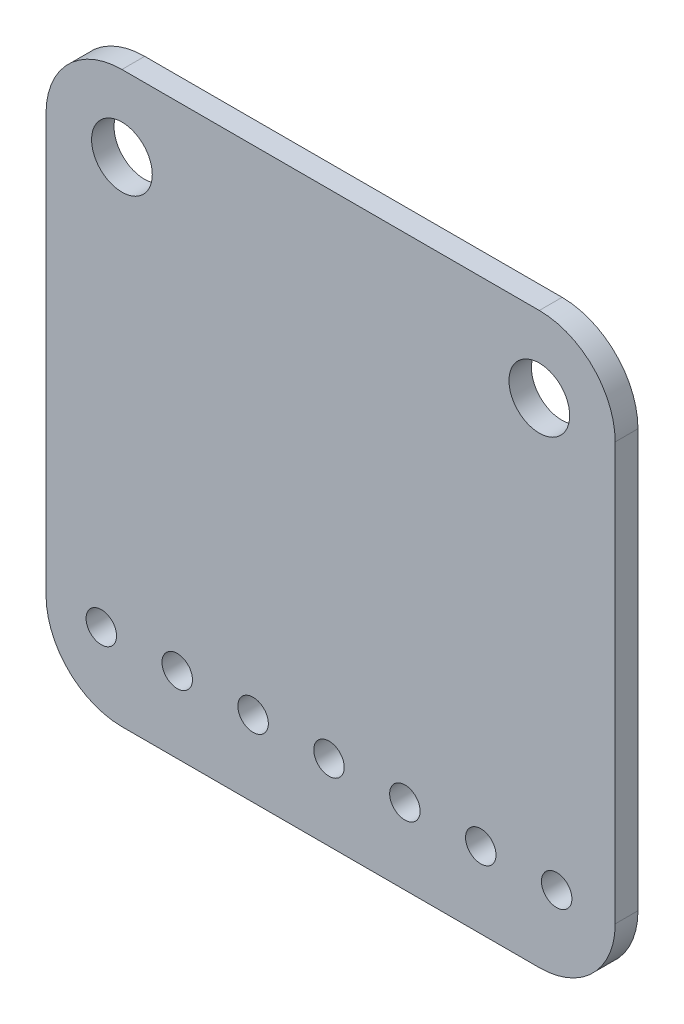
from build123d import *

# Parameters (mm, degrees)
Y_KSEKLIK_EKSTR_ZYON1_DEPTH = 0.762
KES_EKSTR_ZYON1_REACH       = 28.952
IZIM2_R                     = 1.016
KES_EKSTR_ZYON2_REACH       = 28.952
IZIM3_R                     = 0.51
IZIM4_R                     = 1.5
KES_EKSTR_ZYON3_DEPTH       = 0.01
IZIM5_R                     = 1.5
KES_EKSTR_ZYON4_DEPTH       = 0.01
IZIM6_R                     = 0.75
KES_EKSTR_ZYON5_DEPTH       = 0.01
IZIM7_R                     = 0.75
KES_EKSTR_ZYON6_DEPTH       = 0.01
Y_KSEKLIK_EKSTR_ZYON2_DEPTH = 0.1
IZIM9_W                     = 0.047489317
IZIM9_H                     = 0.386698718
Y_KSEKLIK_EKSTR_ZYON4_DEPTH = 0.1
IZIM11_W                    = 5.034397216
IZIM11_H                    = 5.137843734
Y_KSEKLIK_EKSTR_ZYON5_DEPTH = 0.6
IZIM12_W                    = 2.717748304
IZIM12_H                    = 1.321336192
Y_KSEKLIK_EKSTR_ZYON6_DEPTH = 0.4
IZIM13_W                    = 2.687717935
IZIM13_H                    = 1.291305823
IZIM13_W_2                  = 2.70273312
IZIM13_W_3                  = 2.537566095
Y_KSEKLIK_EKSTR_ZYON7_DEPTH = 0.4
IZIM14_W                    = 2.749768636
IZIM14_H                    = 1.266340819
Y_KSEKLIK_EKSTR_ZYON8_DEPTH = 0.4
IZIM15_W                    = 2.012034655
IZIM15_H                    = 2.973006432
Y_KSEKLIK_EKSTR_ZYON9_DEPTH = 0.5


with BuildPart() as part:
    # izim1 → Y_kseklik-Ekstr_zyon1 (new body)
    with BuildSketch(Plane.XY):
        with BuildLine():
            Line((2.54, 0), (16.51, 0))
            ThreePointArc((16.51, 0), (18.306051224, 0.743948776), (19.05, 2.54))
            Line((19.05, 2.54), (19.05, 16.51))
            ThreePointArc((19.05, 16.51), (18.306051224, 18.306051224), (16.51, 19.05))
            Line((16.51, 19.05), (2.54, 19.05))
            ThreePointArc((2.54, 19.05), (0.743948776, 18.306051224), (0, 16.51))
            Line((0, 16.51), (0, 2.54))
            ThreePointArc((0, 2.54), (0.743948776, 0.743948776), (2.54, 0))
        make_face()
    extrude(amount=Y_KSEKLIK_EKSTR_ZYON1_DEPTH)

    # izim2 → Kes-Ekstr_zyon1 (cut, up to next)
    with BuildSketch(Plane.XY.offset(0.762), mode=Mode.PRIVATE) as kes_ekstr_zyon1_sk1:
        with Locations((16.51, 16.51)):
            Circle(IZIM2_R)
    kes_ekstr_zyon1_tool1 = extrude(kes_ekstr_zyon1_sk1.sketch, amount=-KES_EKSTR_ZYON1_REACH, mode=Mode.PRIVATE) & part.part
    # izim2 → Kes-Ekstr_zyon1 (cut, up to next)
    with BuildSketch(Plane.XY.offset(0.762), mode=Mode.PRIVATE) as kes_ekstr_zyon1_sk2:
        with Locations((2.54, 16.51)):
            Circle(IZIM2_R)
    kes_ekstr_zyon1_tool2 = extrude(kes_ekstr_zyon1_sk2.sketch, amount=-KES_EKSTR_ZYON1_REACH, mode=Mode.PRIVATE) & part.part
    add(kes_ekstr_zyon1_tool1.solids().sort_by_distance((16.51, 16.51, 0.762))[0], mode=Mode.SUBTRACT)
    add(kes_ekstr_zyon1_tool2.solids().sort_by_distance((2.54, 16.51, 0.762))[0], mode=Mode.SUBTRACT)

    # izim3 → Kes-Ekstr_zyon2 (cut, up to next)
    with BuildSketch(Plane.XY.offset(0.762), mode=Mode.PRIVATE) as kes_ekstr_zyon2_sk1:
        with Locations((1.850744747, 2.54)):
            Circle(IZIM3_R)
    kes_ekstr_zyon2_tool1 = extrude(kes_ekstr_zyon2_sk1.sketch, amount=-KES_EKSTR_ZYON2_REACH, mode=Mode.PRIVATE) & part.part
    # izim3 → Kes-Ekstr_zyon2 (cut, up to next)
    with BuildSketch(Plane.XY.offset(0.762), mode=Mode.PRIVATE) as kes_ekstr_zyon2_sk2:
        with Locations((4.390744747, 2.54)):
            Circle(IZIM3_R)
    kes_ekstr_zyon2_tool2 = extrude(kes_ekstr_zyon2_sk2.sketch, amount=-KES_EKSTR_ZYON2_REACH, mode=Mode.PRIVATE) & part.part
    # izim3 → Kes-Ekstr_zyon2 (cut, up to next)
    with BuildSketch(Plane.XY.offset(0.762), mode=Mode.PRIVATE) as kes_ekstr_zyon2_sk3:
        with Locations((6.930744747, 2.54)):
            Circle(IZIM3_R)
    kes_ekstr_zyon2_tool3 = extrude(kes_ekstr_zyon2_sk3.sketch, amount=-KES_EKSTR_ZYON2_REACH, mode=Mode.PRIVATE) & part.part
    # izim3 → Kes-Ekstr_zyon2 (cut, up to next)
    with BuildSketch(Plane.XY.offset(0.762), mode=Mode.PRIVATE) as kes_ekstr_zyon2_sk4:
        with Locations((9.470744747, 2.54)):
            Circle(IZIM3_R)
    kes_ekstr_zyon2_tool4 = extrude(kes_ekstr_zyon2_sk4.sketch, amount=-KES_EKSTR_ZYON2_REACH, mode=Mode.PRIVATE) & part.part
    # izim3 → Kes-Ekstr_zyon2 (cut, up to next)
    with BuildSketch(Plane.XY.offset(0.762), mode=Mode.PRIVATE) as kes_ekstr_zyon2_sk5:
        with Locations((12.010744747, 2.54)):
            Circle(IZIM3_R)
    kes_ekstr_zyon2_tool5 = extrude(kes_ekstr_zyon2_sk5.sketch, amount=-KES_EKSTR_ZYON2_REACH, mode=Mode.PRIVATE) & part.part
    # izim3 → Kes-Ekstr_zyon2 (cut, up to next)
    with BuildSketch(Plane.XY.offset(0.762), mode=Mode.PRIVATE) as kes_ekstr_zyon2_sk6:
        with Locations((14.550744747, 2.54)):
            Circle(IZIM3_R)
    kes_ekstr_zyon2_tool6 = extrude(kes_ekstr_zyon2_sk6.sketch, amount=-KES_EKSTR_ZYON2_REACH, mode=Mode.PRIVATE) & part.part
    # izim3 → Kes-Ekstr_zyon2 (cut, up to next)
    with BuildSketch(Plane.XY.offset(0.762), mode=Mode.PRIVATE) as kes_ekstr_zyon2_sk7:
        with Locations((17.090744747, 2.54)):
            Circle(IZIM3_R)
    kes_ekstr_zyon2_tool7 = extrude(kes_ekstr_zyon2_sk7.sketch, amount=-KES_EKSTR_ZYON2_REACH, mode=Mode.PRIVATE) & part.part
    add(kes_ekstr_zyon2_tool1.solids().sort_by_distance((1.850745, 2.54, 0.762))[0], mode=Mode.SUBTRACT)
    add(kes_ekstr_zyon2_tool2.solids().sort_by_distance((4.390745, 2.54, 0.762))[0], mode=Mode.SUBTRACT)
    add(kes_ekstr_zyon2_tool3.solids().sort_by_distance((6.930745, 2.54, 0.762))[0], mode=Mode.SUBTRACT)
    add(kes_ekstr_zyon2_tool4.solids().sort_by_distance((9.470745, 2.54, 0.762))[0], mode=Mode.SUBTRACT)
    add(kes_ekstr_zyon2_tool5.solids().sort_by_distance((12.010745, 2.54, 0.762))[0], mode=Mode.SUBTRACT)
    add(kes_ekstr_zyon2_tool6.solids().sort_by_distance((14.550745, 2.54, 0.762))[0], mode=Mode.SUBTRACT)
    add(kes_ekstr_zyon2_tool7.solids().sort_by_distance((17.090745, 2.54, 0.762))[0], mode=Mode.SUBTRACT)

    # izim4 → Kes-Ekstr_zyon3 (cut)
    with BuildSketch(Plane(origin=(0, 0, 0), x_dir=(-1, 0, 0), z_dir=(0, 0, -1))):
        with Locations((-16.51, 16.51)):
            Circle(IZIM4_R)
    extrude(amount=-KES_EKSTR_ZYON3_DEPTH, mode=Mode.SUBTRACT)

    # izim5 → Kes-Ekstr_zyon4 (cut)
    with BuildSketch(Plane(origin=(0, 0, 0), x_dir=(-1, 0, 0), z_dir=(0, 0, -1))):
        with Locations((-2.54, 16.51)):
            Circle(IZIM5_R)
    extrude(amount=-KES_EKSTR_ZYON4_DEPTH, mode=Mode.SUBTRACT)

    # izim6 → Kes-Ekstr_zyon5 (cut)
    with BuildSketch(Plane(origin=(0, 0, 0), x_dir=(-1, 0, 0), z_dir=(0, 0, -1))):
        with Locations((-17.090744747, 2.54)):
            Circle(IZIM6_R)
    extrude(amount=-KES_EKSTR_ZYON5_DEPTH, mode=Mode.SUBTRACT)

    # izim7 → Kes-Ekstr_zyon6 (cut)
    with BuildSketch(Plane(origin=(0, 0, 0), x_dir=(-1, 0, 0), z_dir=(0, 0, -1))):
        with Locations((-14.550744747, 2.54)):
            Circle(IZIM7_R)
        with Locations((-12.010744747, 2.54)):
            Circle(IZIM7_R)
        with Locations((-9.470744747, 2.54)):
            Circle(IZIM7_R)
        with Locations((-6.930744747, 2.54)):
            Circle(IZIM7_R)
        with Locations((-4.390744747, 2.54)):
            Circle(IZIM7_R)
        with Locations((-1.850744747, 2.54)):
            Circle(IZIM7_R)
    extrude(amount=-KES_EKSTR_ZYON6_DEPTH, mode=Mode.SUBTRACT)

    # izim8 → Y_kseklik-Ekstr_zyon2 (add)
    # profile 1 of 7: a face of its own
    with BuildSketch(Plane(origin=(0, 0, 0), x_dir=(-1, 0, 0), z_dir=(0, 0, -1))):
        Polygon((-12.627294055, 17.535305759), (-12.016717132, 16.212389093), (-12.145775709, 16.212389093), (-12.341351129, 16.636400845), (-12.941062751, 16.636400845), (-13.142203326, 16.212389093), (-13.271791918, 16.212389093), (-12.644254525, 17.535305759), align=None)
        Polygon((-12.637099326, 17.277453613), (-12.876665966, 16.772084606), (-12.403892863, 16.772084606), align=None, mode=Mode.SUBTRACT)
    # profile 2 of 7: a face of its own
    with BuildSketch(Plane(origin=(0, 0, 0), x_dir=(-1, 0, 0), z_dir=(0, 0, -1))):
        with BuildLine():
            Line((-11.77927055, 16.212389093), (-11.77927055, 17.535305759))
            Line((-11.77927055, 17.535305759), (-11.512143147, 17.535305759))
            add(Edge.make_bspline(
                [(-11.512143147, 17.535305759), (-11.488909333, 17.535138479), (-11.444021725, 17.534815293), (-11.379156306, 17.532766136), (-11.319139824, 17.529141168), (-11.264169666, 17.52386102), (-11.214094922, 17.517377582), (-11.169055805, 17.509250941), (-11.12881943, 17.499654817), (-11.10407354, 17.491473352), (-11.092371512, 17.487604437)],
                knots=[0, 0, 0, 0, 1.314313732, 2.53924729, 3.670748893, 4.714932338, 5.66265055, 6.526160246, 7.303039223, 8, 8, 8, 8], degree=3))
            add(Edge.make_bspline(
                [(-11.092371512, 17.487604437), (-11.077065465, 17.481771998), (-11.04680046, 17.47023938), (-11.003708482, 17.448484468), (-10.963142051, 17.423835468), (-10.924883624, 17.396259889), (-10.889807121, 17.364976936), (-10.856542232, 17.331315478), (-10.826449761, 17.294051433), (-10.798892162, 17.253957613), (-10.774045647, 17.211506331), (-10.752448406, 17.166778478), (-10.734511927, 17.1200012), (-10.719622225, 17.071304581), (-10.707887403, 17.020581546), (-10.699881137, 16.967773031), (-10.694600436, 16.913087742), (-10.694069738, 16.875980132), (-10.693800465, 16.857151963)],
                knots=[0, 0, 0, 0, 0.984719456, 1.947108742, 2.898477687, 3.838006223, 4.779231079, 5.722358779, 6.681677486, 7.655904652, 8.64651281, 9.637519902, 10.640069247, 11.656948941, 12.698408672, 13.768548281, 14.867775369, 16, 16, 16, 16], degree=3))
            add(Edge.make_bspline(
                [(-10.693800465, 16.857151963), (-10.6940382, 16.840800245), (-10.694506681, 16.808577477), (-10.698713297, 16.76108821), (-10.704827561, 16.715007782), (-10.714293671, 16.670555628), (-10.725785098, 16.627342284), (-10.740512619, 16.58582831), (-10.757383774, 16.545632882), (-10.777057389, 16.507299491), (-10.798655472, 16.470982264), (-10.821833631, 16.436746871), (-10.846567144, 16.405081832), (-10.873091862, 16.375891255), (-10.901065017, 16.349219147), (-10.930669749, 16.324842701), (-10.961982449, 16.303238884), (-10.994862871, 16.283558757), (-11.030270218, 16.266390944), (-11.068875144, 16.251865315), (-11.110842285, 16.239828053), (-11.156068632, 16.229784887), (-11.204632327, 16.221818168), (-11.256580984, 16.216478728), (-11.311834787, 16.212867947), (-11.349775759, 16.21255181), (-11.369304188, 16.212389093)],
                knots=[0, 0, 0, 0, 1.105936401, 2.179363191, 3.223086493, 4.248585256, 5.251745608, 6.245858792, 7.225916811, 8.198733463, 9.158002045, 10.082870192, 10.993790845, 11.873723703, 12.748670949, 13.606408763, 14.465103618, 15.319838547, 16.196477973, 17.123216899, 18.106603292, 19.147568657, 20.255746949, 21.433717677, 22.679120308, 24, 24, 24, 24], degree=3))
            Line((-11.369304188, 16.212389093), (-11.77927055, 16.212389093))
        make_face()
        with BuildLine():
            Line((-11.66054726, 16.348072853), (-11.508698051, 16.348072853))
            add(Edge.make_bspline(
                [(-11.508698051, 16.348072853), (-11.486878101, 16.348166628), (-11.444910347, 16.348346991), (-11.384563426, 16.349929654), (-11.329424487, 16.352515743), (-11.279485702, 16.356134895), (-11.234775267, 16.36092333), (-11.195199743, 16.366262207), (-11.160888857, 16.372913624), (-11.140126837, 16.378942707), (-11.13053257, 16.381728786)],
                knots=[0, 0, 0, 0, 1.375205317, 2.645023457, 3.804390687, 4.853969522, 5.800190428, 6.637939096, 7.370582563, 8, 8, 8, 8], degree=3))
            add(Edge.make_bspline(
                [(-11.13053257, 16.381728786), (-11.118456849, 16.385981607), (-11.094593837, 16.394385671), (-11.060242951, 16.409715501), (-11.028206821, 16.42787426), (-10.997927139, 16.448059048), (-10.969833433, 16.470981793), (-10.94359277, 16.496144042), (-10.919257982, 16.523673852), (-10.897080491, 16.553537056), (-10.877233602, 16.585547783), (-10.86004656, 16.61939133), (-10.84498363, 16.65469688), (-10.833161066, 16.692006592), (-10.823894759, 16.73098692), (-10.817331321, 16.771640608), (-10.813243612, 16.813960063), (-10.812766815, 16.842743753), (-10.812523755, 16.857416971)],
                knots=[0, 0, 0, 0, 0.998632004, 1.973411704, 2.929992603, 3.868527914, 4.809262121, 5.754881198, 6.702106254, 7.672490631, 8.653608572, 9.636854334, 10.631411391, 11.644891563, 12.686317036, 13.754757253, 14.855430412, 16, 16, 16, 16], degree=3))
            add(Edge.make_bspline(
                [(-10.812523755, 16.857416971), (-10.812717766, 16.872888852), (-10.813098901, 16.903283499), (-10.817889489, 16.947881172), (-10.824890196, 16.990774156), (-10.835013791, 17.031965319), (-10.847914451, 17.071535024), (-10.864014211, 17.109264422), (-10.882409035, 17.145551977), (-10.904295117, 17.179560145), (-10.928264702, 17.211723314), (-10.954865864, 17.241188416), (-10.98367598, 17.268022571), (-11.014380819, 17.29264368), (-11.047845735, 17.314061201), (-11.083282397, 17.333219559), (-11.121210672, 17.349478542), (-11.147598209, 17.358126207), (-11.161008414, 17.36252097)],
                knots=[0, 0, 0, 0, 1.122418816, 2.205001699, 3.251619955, 4.274784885, 5.280384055, 6.268708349, 7.249350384, 8.229342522, 9.199999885, 10.157847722, 11.105861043, 12.055065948, 13.010012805, 13.98527497, 14.976112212, 16, 16, 16, 16], degree=3))
            add(Edge.make_bspline(
                [(-11.161008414, 17.36252097), (-11.172102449, 17.365588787), (-11.19569141, 17.372111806), (-11.234184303, 17.379227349), (-11.2775061, 17.385503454), (-11.325849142, 17.390817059), (-11.379158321, 17.394629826), (-11.437474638, 17.397491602), (-11.500823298, 17.399421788), (-11.54473753, 17.399553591), (-11.567529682, 17.399621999)],
                knots=[0, 0, 0, 0, 0.674548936, 1.434276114, 2.292660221, 3.240891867, 4.284742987, 5.42552168, 6.663806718, 8, 8, 8, 8], degree=3))
            Line((-11.567529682, 17.399621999), (-11.66054726, 17.399621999))
            Line((-11.66054726, 17.399621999), (-11.66054726, 16.348072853))
        make_face(mode=Mode.SUBTRACT)
    # profile 3 of 7: a face of its own
    with BuildSketch(Plane(origin=(0, 0, 0), x_dir=(-1, 0, 0), z_dir=(0, 0, -1))):
        Polygon((-10.515715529, 17.535305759), (-10.378706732, 17.535305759), (-10.032342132, 16.994160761), (-9.685977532, 17.535305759), (-9.548968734, 17.535305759), (-9.963705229, 16.887097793), (-9.532008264, 16.212389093), (-9.669017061, 16.212389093), (-10.032342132, 16.780034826), (-10.395667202, 16.212389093), (-10.532675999, 16.212389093), (-10.100714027, 16.887097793), align=None)
    # profile 4 of 7: a face of its own
    with BuildSketch(Plane(origin=(0, 0, 0), x_dir=(-1, 0, 0), z_dir=(0, 0, -1))):
        Polygon((-9.303041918, 17.535305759), (-9.184318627, 17.535305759), (-9.184318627, 16.348072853), (-8.675504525, 16.348072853), (-8.675504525, 16.212389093), (-9.303041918, 16.212389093), align=None)
    # profile 5 of 7: a face of its own
    with BuildSketch(Plane(origin=(0, 0, 0), x_dir=(-1, 0, 0), z_dir=(0, 0, -1))):
        with BuildLine():
            Line((-8.404137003, 17.230017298), (-8.522860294, 17.230017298))
            add(Edge.make_bspline(
                [(-8.522860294, 17.230017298), (-8.519643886, 17.243334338), (-8.513356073, 17.269368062), (-8.500241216, 17.306563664), (-8.485953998, 17.341762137), (-8.468797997, 17.374304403), (-8.450084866, 17.404844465), (-8.428645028, 17.43268964), (-8.405467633, 17.458548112), (-8.379831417, 17.48149627), (-8.352946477, 17.502276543), (-8.324433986, 17.519994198), (-8.294867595, 17.535235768), (-8.264042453, 17.547792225), (-8.231866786, 17.557251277), (-8.198631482, 17.564114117), (-8.164249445, 17.568570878), (-8.140910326, 17.569005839), (-8.129059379, 17.5692267)],
                knots=[0, 0, 0, 0, 1.162005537, 2.271625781, 3.343758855, 4.383309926, 5.390229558, 6.379919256, 7.361854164, 8.333198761, 9.295911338, 10.242430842, 11.177959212, 12.116337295, 13.062827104, 14.020064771, 14.994644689, 16, 16, 16, 16], degree=3))
            add(Edge.make_bspline(
                [(-8.129059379, 17.5692267), (-8.11179239, 17.568705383), (-8.077635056, 17.567674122), (-8.027453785, 17.558257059), (-7.979062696, 17.543355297), (-7.932991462, 17.522765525), (-7.89019759, 17.497370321), (-7.85212171, 17.467145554), (-7.819279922, 17.43267439), (-7.791727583, 17.394599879), (-7.770154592, 17.353908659), (-7.754246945, 17.312028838), (-7.74456256, 17.26905976), (-7.743307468, 17.240047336), (-7.74267867, 17.225512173)],
                knots=[0, 0, 0, 0, 1.083050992, 2.142477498, 3.193116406, 4.255571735, 5.30263384, 6.308962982, 7.297363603, 8.282367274, 9.249857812, 10.179914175, 11.08814088, 12, 12, 12, 12], degree=3))
            add(Edge.make_bspline(
                [(-7.74267867, 17.225512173), (-7.74311848, 17.211524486), (-7.743979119, 17.184152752), (-7.751286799, 17.144192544), (-7.763584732, 17.106530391), (-7.780620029, 17.071007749), (-7.802671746, 17.037849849), (-7.829384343, 17.006982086), (-7.860946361, 16.978267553), (-7.884864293, 16.961818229), (-7.897177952, 16.95334963)],
                knots=[0, 0, 0, 0, 1.024540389, 2.004866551, 2.965041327, 3.920577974, 4.882998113, 5.874504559, 6.905732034, 8, 8, 8, 8], degree=3))
            add(Edge.make_bspline(
                [(-7.897177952, 16.95334963), (-7.883105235, 16.946554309), (-7.855223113, 16.933090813), (-7.817217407, 16.906687), (-7.782716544, 16.876200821), (-7.76347615, 16.852409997), (-7.753808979, 16.840456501)],
                knots=[0, 0, 0, 0, 1.015518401, 2.012035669, 3.001164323, 4, 4, 4, 4], degree=3))
            add(Edge.make_bspline(
                [(-7.753808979, 16.840456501), (-7.747443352, 16.831741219), (-7.734816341, 16.814453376), (-7.719230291, 16.786658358), (-7.705090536, 16.758555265), (-7.694072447, 16.729390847), (-7.685540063, 16.69950313), (-7.679441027, 16.668840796), (-7.675652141, 16.637378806), (-7.675109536, 16.616094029), (-7.67483679, 16.605394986)],
                knots=[0, 0, 0, 0, 1.025084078, 2.033381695, 3.024893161, 4.013698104, 4.991890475, 5.976764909, 6.982997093, 8, 8, 8, 8], degree=3))
            add(Edge.make_bspline(
                [(-7.67483679, 16.605394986), (-7.675515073, 16.586870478), (-7.676868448, 16.549908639), (-7.688965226, 16.495300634), (-7.70771785, 16.441920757), (-7.734348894, 16.390865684), (-7.766804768, 16.343096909), (-7.805417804, 16.300356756), (-7.849749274, 16.263617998), (-7.899190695, 16.232922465), (-7.952756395, 16.208385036), (-8.01004836, 16.191354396), (-8.070241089, 16.180262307), (-8.111518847, 16.179072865), (-8.132504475, 16.178468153)],
                knots=[0, 0, 0, 0, 0.955779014, 1.907060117, 2.875433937, 3.871313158, 4.872415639, 5.851225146, 6.836215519, 7.83643374, 8.849228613, 9.86973379, 10.916971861, 12, 12, 12, 12], degree=3))
            add(Edge.make_bspline(
                [(-8.132504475, 16.178468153), (-8.146648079, 16.178796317), (-8.174477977, 16.179442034), (-8.215391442, 16.183856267), (-8.254444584, 16.191918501), (-8.291690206, 16.202767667), (-8.327161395, 16.216522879), (-8.360749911, 16.233652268), (-8.392662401, 16.253802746), (-8.422597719, 16.277212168), (-8.450552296, 16.303398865), (-8.475783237, 16.332827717), (-8.498711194, 16.364954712), (-8.518722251, 16.40015301), (-8.536727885, 16.437967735), (-8.551537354, 16.47888309), (-8.564572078, 16.522533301), (-8.570632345, 16.55295197), (-8.573741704, 16.568558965)],
                knots=[0, 0, 0, 0, 1.048658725, 2.063410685, 3.046034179, 4.001477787, 4.936774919, 5.862367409, 6.792675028, 7.730719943, 8.675894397, 9.627829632, 10.600096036, 11.597688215, 12.626045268, 13.701542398, 14.82072376, 16, 16, 16, 16], degree=3))
            Line((-8.573741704, 16.568558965), (-8.455018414, 16.568558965))
            add(Edge.make_bspline(
                [(-8.455018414, 16.568558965), (-8.451925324, 16.558372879), (-8.445908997, 16.538560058), (-8.435667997, 16.510045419), (-8.424000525, 16.483905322), (-8.411484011, 16.459948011), (-8.398338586, 16.437937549), (-8.383629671, 16.41845595), (-8.368446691, 16.400647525), (-8.357001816, 16.390614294), (-8.351400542, 16.385703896)],
                knots=[0, 0, 0, 0, 1.198163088, 2.33053128, 3.407730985, 4.417276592, 5.372219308, 6.28897303, 7.162600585, 8, 8, 8, 8], degree=3))
            add(Edge.make_bspline(
                [(-8.351400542, 16.385703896), (-8.343993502, 16.379993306), (-8.329202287, 16.368589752), (-8.305099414, 16.354037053), (-8.279750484, 16.34142738), (-8.252606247, 16.33179515), (-8.22425245, 16.323639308), (-8.194230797, 16.318302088), (-8.162806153, 16.31464019), (-8.14134929, 16.314317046), (-8.130384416, 16.314151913)],
                knots=[0, 0, 0, 0, 0.946170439, 1.889420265, 2.845303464, 3.807233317, 4.801018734, 5.828864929, 6.890507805, 8, 8, 8, 8], degree=3))
            add(Edge.make_bspline(
                [(-8.130384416, 16.314151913), (-8.118004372, 16.314384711), (-8.093796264, 16.314839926), (-8.058472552, 16.31902628), (-8.024867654, 16.325123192), (-7.993354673, 16.334539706), (-7.963520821, 16.346174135), (-7.935784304, 16.360782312), (-7.909781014, 16.377921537), (-7.885844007, 16.397402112), (-7.864319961, 16.418728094), (-7.845368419, 16.44103363), (-7.829257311, 16.464224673), (-7.816261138, 16.488429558), (-7.805998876, 16.513548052), (-7.799012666, 16.539650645), (-7.794155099, 16.566523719), (-7.793759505, 16.584790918), (-7.79356008, 16.59399967)],
                knots=[0, 0, 0, 0, 1.217147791, 2.380027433, 3.494444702, 4.572153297, 5.609568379, 6.639424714, 7.649109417, 8.668170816, 9.669597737, 10.625200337, 11.543417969, 12.441394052, 13.322311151, 14.205496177, 15.095365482, 16, 16, 16, 16], degree=3))
            add(Edge.make_bspline(
                [(-7.79356008, 16.59399967), (-7.794138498, 16.606325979), (-7.795292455, 16.630917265), (-7.804102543, 16.667096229), (-7.818593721, 16.701954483), (-7.838880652, 16.734897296), (-7.863576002, 16.765428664), (-7.892440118, 16.792669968), (-7.925712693, 16.815148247), (-7.956336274, 16.83067878), (-7.983461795, 16.841276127), (-8.006675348, 16.848334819), (-8.032663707, 16.854312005), (-8.061112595, 16.859872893), (-8.09223637, 16.864605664), (-8.126001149, 16.868552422), (-8.162413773, 16.871710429), (-8.187621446, 16.873120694), (-8.200611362, 16.873847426)],
                knots=[0, 0, 0, 0, 1.07054697, 2.135767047, 3.216561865, 4.33974944, 5.486079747, 6.621378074, 7.775625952, 8.963672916, 9.598146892, 10.304877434, 11.070270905, 11.915000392, 12.823868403, 13.805723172, 14.86925407, 16, 16, 16, 16], degree=3))
            Line((-8.200611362, 16.873847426), (-8.200611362, 17.009531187))
            add(Edge.make_bspline(
                [(-8.200611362, 17.009531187), (-8.184244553, 17.009808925), (-8.152185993, 17.010352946), (-8.105356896, 17.01693276), (-8.060576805, 17.026034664), (-8.018838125, 17.039976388), (-7.980795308, 17.056169), (-7.947790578, 17.075011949), (-7.920286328, 17.095957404), (-7.898416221, 17.119328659), (-7.881963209, 17.144394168), (-7.869933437, 17.170518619), (-7.862827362, 17.197930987), (-7.861878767, 17.216638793), (-7.861401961, 17.226042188)],
                knots=[0, 0, 0, 0, 1.321986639, 2.589447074, 3.816329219, 5.01088745, 6.139805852, 7.153945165, 8.075214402, 8.924034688, 9.728124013, 10.488707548, 11.240355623, 12, 12, 12, 12], degree=3))
            add(Edge.make_bspline(
                [(-7.861401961, 17.226042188), (-7.861558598, 17.23295074), (-7.861870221, 17.246694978), (-7.865800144, 17.266774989), (-7.87170566, 17.28624112), (-7.879824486, 17.30501059), (-7.890691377, 17.322953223), (-7.90369602, 17.340221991), (-7.919180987, 17.356718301), (-7.936925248, 17.372094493), (-7.95597971, 17.386748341), (-7.97686281, 17.399188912), (-7.998944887, 17.409827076), (-8.022250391, 17.418599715), (-8.046854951, 17.42519891), (-8.072642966, 17.42993716), (-8.099663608, 17.432899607), (-8.118098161, 17.433326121), (-8.127469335, 17.433542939)],
                knots=[0, 0, 0, 0, 0.884392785, 1.759457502, 2.611959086, 3.489218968, 4.37281399, 5.2945488, 6.255912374, 7.266815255, 8.301784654, 9.332968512, 10.37626691, 11.440494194, 12.520033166, 13.637162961, 14.798855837, 16, 16, 16, 16], degree=3))
            add(Edge.make_bspline(
                [(-8.127469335, 17.433542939), (-8.142532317, 17.433017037), (-8.171953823, 17.431989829), (-8.21436839, 17.422992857), (-8.253798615, 17.408638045), (-8.283937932, 17.391503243), (-8.306194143, 17.374588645), (-8.322098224, 17.359816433), (-8.337716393, 17.34339986), (-8.352021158, 17.324327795), (-8.36648781, 17.303891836), (-8.379658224, 17.281053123), (-8.392456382, 17.256407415), (-8.40016806, 17.238984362), (-8.404137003, 17.230017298)],
                knots=[0, 0, 0, 0, 1.472543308, 2.876219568, 4.221790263, 5.565193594, 6.249813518, 6.953379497, 7.687249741, 8.463570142, 9.283606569, 10.136032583, 11.040678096, 12, 12, 12, 12], degree=3))
        make_face()
    # profile 6 of 7: a face of its own
    with BuildSketch(Plane(origin=(0, 0, 0), x_dir=(-1, 0, 0), z_dir=(0, 0, -1))):
        with BuildLine():
            Line((-7.386508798, 17.230017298), (-7.505232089, 17.230017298))
            add(Edge.make_bspline(
                [(-7.505232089, 17.230017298), (-7.502015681, 17.243334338), (-7.495727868, 17.269368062), (-7.482613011, 17.306563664), (-7.468325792, 17.341762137), (-7.451169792, 17.374304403), (-7.432456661, 17.404844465), (-7.411016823, 17.43268964), (-7.387839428, 17.458548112), (-7.362203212, 17.48149627), (-7.335318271, 17.502276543), (-7.306805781, 17.519994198), (-7.27723939, 17.535235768), (-7.246414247, 17.547792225), (-7.214238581, 17.557251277), (-7.181003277, 17.564114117), (-7.14662124, 17.568570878), (-7.123282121, 17.569005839), (-7.111431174, 17.5692267)],
                knots=[0, 0, 0, 0, 1.162005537, 2.271625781, 3.343758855, 4.383309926, 5.390229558, 6.379919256, 7.361854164, 8.333198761, 9.295911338, 10.242430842, 11.177959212, 12.116337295, 13.062827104, 14.020064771, 14.994644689, 16, 16, 16, 16], degree=3))
            add(Edge.make_bspline(
                [(-7.111431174, 17.5692267), (-7.094164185, 17.568705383), (-7.060006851, 17.567674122), (-7.00982558, 17.558257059), (-6.961434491, 17.543355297), (-6.915363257, 17.522765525), (-6.872569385, 17.497370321), (-6.834493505, 17.467145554), (-6.801651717, 17.43267439), (-6.774099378, 17.394599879), (-6.752526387, 17.353908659), (-6.73661874, 17.312028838), (-6.726934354, 17.26905976), (-6.725679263, 17.240047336), (-6.725050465, 17.225512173)],
                knots=[0, 0, 0, 0, 1.083050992, 2.142477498, 3.193116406, 4.255571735, 5.30263384, 6.308962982, 7.297363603, 8.282367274, 9.249857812, 10.179914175, 11.08814088, 12, 12, 12, 12], degree=3))
            add(Edge.make_bspline(
                [(-6.725050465, 17.225512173), (-6.725490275, 17.211524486), (-6.726350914, 17.184152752), (-6.733658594, 17.144192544), (-6.745956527, 17.106530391), (-6.762991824, 17.071007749), (-6.785043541, 17.037849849), (-6.811756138, 17.006982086), (-6.843318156, 16.978267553), (-6.867236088, 16.961818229), (-6.879549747, 16.95334963)],
                knots=[0, 0, 0, 0, 1.024540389, 2.004866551, 2.965041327, 3.920577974, 4.882998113, 5.874504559, 6.905732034, 8, 8, 8, 8], degree=3))
            add(Edge.make_bspline(
                [(-6.879549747, 16.95334963), (-6.86547703, 16.946554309), (-6.837594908, 16.933090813), (-6.799589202, 16.906687), (-6.765088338, 16.876200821), (-6.745847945, 16.852409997), (-6.736180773, 16.840456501)],
                knots=[0, 0, 0, 0, 1.015518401, 2.012035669, 3.001164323, 4, 4, 4, 4], degree=3))
            add(Edge.make_bspline(
                [(-6.736180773, 16.840456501), (-6.729815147, 16.831741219), (-6.717188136, 16.814453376), (-6.701602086, 16.786658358), (-6.687462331, 16.758555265), (-6.676444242, 16.729390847), (-6.667911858, 16.69950313), (-6.661812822, 16.668840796), (-6.658023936, 16.637378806), (-6.657481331, 16.616094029), (-6.657208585, 16.605394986)],
                knots=[0, 0, 0, 0, 1.025084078, 2.033381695, 3.024893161, 4.013698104, 4.991890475, 5.976764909, 6.982997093, 8, 8, 8, 8], degree=3))
            add(Edge.make_bspline(
                [(-6.657208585, 16.605394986), (-6.657886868, 16.586870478), (-6.659240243, 16.549908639), (-6.671337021, 16.495300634), (-6.690089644, 16.441920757), (-6.716720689, 16.390865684), (-6.749176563, 16.343096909), (-6.787789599, 16.300356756), (-6.832121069, 16.263617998), (-6.88156249, 16.232922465), (-6.93512819, 16.208385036), (-6.992420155, 16.191354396), (-7.052612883, 16.180262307), (-7.093890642, 16.179072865), (-7.11487627, 16.178468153)],
                knots=[0, 0, 0, 0, 0.955779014, 1.907060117, 2.875433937, 3.871313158, 4.872415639, 5.851225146, 6.836215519, 7.83643374, 8.849228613, 9.86973379, 10.916971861, 12, 12, 12, 12], degree=3))
            add(Edge.make_bspline(
                [(-7.11487627, 16.178468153), (-7.129019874, 16.178796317), (-7.156849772, 16.179442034), (-7.197763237, 16.183856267), (-7.236816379, 16.191918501), (-7.274062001, 16.202767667), (-7.30953319, 16.216522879), (-7.343121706, 16.233652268), (-7.375034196, 16.253802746), (-7.404969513, 16.277212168), (-7.432924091, 16.303398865), (-7.458155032, 16.332827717), (-7.481082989, 16.364954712), (-7.501094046, 16.40015301), (-7.51909968, 16.437967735), (-7.533909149, 16.47888309), (-7.546943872, 16.522533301), (-7.55300414, 16.55295197), (-7.556113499, 16.568558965)],
                knots=[0, 0, 0, 0, 1.048658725, 2.063410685, 3.046034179, 4.001477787, 4.936774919, 5.862367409, 6.792675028, 7.730719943, 8.675894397, 9.627829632, 10.600096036, 11.597688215, 12.626045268, 13.701542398, 14.82072376, 16, 16, 16, 16], degree=3))
            Line((-7.556113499, 16.568558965), (-7.437390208, 16.568558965))
            add(Edge.make_bspline(
                [(-7.437390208, 16.568558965), (-7.434297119, 16.558372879), (-7.428280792, 16.538560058), (-7.418039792, 16.510045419), (-7.40637232, 16.483905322), (-7.393855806, 16.459948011), (-7.380710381, 16.437937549), (-7.366001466, 16.41845595), (-7.350818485, 16.400647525), (-7.339373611, 16.390614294), (-7.333772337, 16.385703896)],
                knots=[0, 0, 0, 0, 1.198163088, 2.33053128, 3.407730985, 4.417276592, 5.372219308, 6.28897303, 7.162600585, 8, 8, 8, 8], degree=3))
            add(Edge.make_bspline(
                [(-7.333772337, 16.385703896), (-7.326365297, 16.379993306), (-7.311574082, 16.368589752), (-7.287471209, 16.354037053), (-7.262122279, 16.34142738), (-7.234978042, 16.33179515), (-7.206624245, 16.323639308), (-7.176602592, 16.318302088), (-7.145177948, 16.31464019), (-7.123721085, 16.314317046), (-7.112756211, 16.314151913)],
                knots=[0, 0, 0, 0, 0.946170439, 1.889420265, 2.845303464, 3.807233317, 4.801018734, 5.828864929, 6.890507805, 8, 8, 8, 8], degree=3))
            add(Edge.make_bspline(
                [(-7.112756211, 16.314151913), (-7.100376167, 16.314384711), (-7.076168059, 16.314839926), (-7.040844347, 16.31902628), (-7.007239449, 16.325123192), (-6.975726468, 16.334539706), (-6.945892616, 16.346174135), (-6.918156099, 16.360782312), (-6.892152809, 16.377921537), (-6.868215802, 16.397402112), (-6.846691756, 16.418728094), (-6.827740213, 16.44103363), (-6.811629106, 16.464224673), (-6.798632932, 16.488429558), (-6.788370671, 16.513548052), (-6.781384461, 16.539650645), (-6.776526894, 16.566523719), (-6.7761313, 16.584790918), (-6.775931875, 16.59399967)],
                knots=[0, 0, 0, 0, 1.217147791, 2.380027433, 3.494444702, 4.572153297, 5.609568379, 6.639424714, 7.649109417, 8.668170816, 9.669597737, 10.625200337, 11.543417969, 12.441394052, 13.322311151, 14.205496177, 15.095365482, 16, 16, 16, 16], degree=3))
            add(Edge.make_bspline(
                [(-6.775931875, 16.59399967), (-6.776510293, 16.606325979), (-6.77766425, 16.630917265), (-6.786474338, 16.667096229), (-6.800965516, 16.701954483), (-6.821252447, 16.734897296), (-6.845947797, 16.765428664), (-6.874811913, 16.792669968), (-6.908084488, 16.815148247), (-6.938708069, 16.83067878), (-6.96583359, 16.841276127), (-6.989047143, 16.848334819), (-7.015035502, 16.854312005), (-7.04348439, 16.859872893), (-7.074608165, 16.864605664), (-7.108372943, 16.868552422), (-7.144785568, 16.871710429), (-7.16999324, 16.873120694), (-7.182983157, 16.873847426)],
                knots=[0, 0, 0, 0, 1.07054697, 2.135767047, 3.216561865, 4.33974944, 5.486079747, 6.621378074, 7.775625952, 8.963672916, 9.598146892, 10.304877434, 11.070270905, 11.915000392, 12.823868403, 13.805723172, 14.86925407, 16, 16, 16, 16], degree=3))
            Line((-7.182983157, 16.873847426), (-7.182983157, 17.009531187))
            add(Edge.make_bspline(
                [(-7.182983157, 17.009531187), (-7.166616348, 17.009808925), (-7.134557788, 17.010352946), (-7.087728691, 17.01693276), (-7.042948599, 17.026034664), (-7.00120992, 17.039976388), (-6.963167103, 17.056169), (-6.930162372, 17.075011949), (-6.902658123, 17.095957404), (-6.880788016, 17.119328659), (-6.864335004, 17.144394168), (-6.852305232, 17.170518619), (-6.845199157, 17.197930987), (-6.844250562, 17.216638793), (-6.843773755, 17.226042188)],
                knots=[0, 0, 0, 0, 1.321986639, 2.589447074, 3.816329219, 5.01088745, 6.139805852, 7.153945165, 8.075214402, 8.924034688, 9.728124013, 10.488707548, 11.240355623, 12, 12, 12, 12], degree=3))
            add(Edge.make_bspline(
                [(-6.843773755, 17.226042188), (-6.843930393, 17.23295074), (-6.844242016, 17.246694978), (-6.848171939, 17.266774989), (-6.854077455, 17.28624112), (-6.862196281, 17.30501059), (-6.873063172, 17.322953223), (-6.886067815, 17.340221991), (-6.901552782, 17.356718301), (-6.919297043, 17.372094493), (-6.938351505, 17.386748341), (-6.959234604, 17.399188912), (-6.981316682, 17.409827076), (-7.004622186, 17.418599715), (-7.029226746, 17.42519891), (-7.055014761, 17.42993716), (-7.082035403, 17.432899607), (-7.100469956, 17.433326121), (-7.10984113, 17.433542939)],
                knots=[0, 0, 0, 0, 0.884392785, 1.759457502, 2.611959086, 3.489218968, 4.37281399, 5.2945488, 6.255912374, 7.266815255, 8.301784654, 9.332968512, 10.37626691, 11.440494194, 12.520033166, 13.637162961, 14.798855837, 16, 16, 16, 16], degree=3))
            add(Edge.make_bspline(
                [(-7.10984113, 17.433542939), (-7.124904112, 17.433017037), (-7.154325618, 17.431989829), (-7.196740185, 17.422992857), (-7.236170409, 17.408638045), (-7.266309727, 17.391503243), (-7.288565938, 17.374588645), (-7.304470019, 17.359816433), (-7.320088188, 17.34339986), (-7.334392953, 17.324327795), (-7.348859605, 17.303891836), (-7.362030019, 17.281053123), (-7.374828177, 17.256407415), (-7.382539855, 17.238984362), (-7.386508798, 17.230017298)],
                knots=[0, 0, 0, 0, 1.472543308, 2.876219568, 4.221790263, 5.565193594, 6.249813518, 6.953379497, 7.687249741, 8.463570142, 9.283606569, 10.136032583, 11.040678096, 12, 12, 12, 12], degree=3))
        make_face()
    # profile 7 of 7: a face of its own
    with BuildSketch(Plane(origin=(0, 0, 0), x_dir=(-1, 0, 0), z_dir=(0, 0, -1))):
        with BuildLine():
            Line((-5.70742226, 17.535305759), (-5.70742226, 17.399621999))
            Line((-5.70742226, 17.399621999), (-6.157404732, 17.399621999))
            Line((-6.157404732, 17.399621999), (-6.228691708, 17.051667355))
            add(Edge.make_bspline(
                [(-6.228691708, 17.051667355), (-6.214685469, 17.055534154), (-6.187550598, 17.063025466), (-6.147500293, 17.071343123), (-6.109478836, 17.076357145), (-6.0848063, 17.077041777), (-6.072867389, 17.077373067)],
                knots=[0, 0, 0, 0, 1.100273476, 2.13160584, 3.095893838, 4, 4, 4, 4], degree=3))
            add(Edge.make_bspline(
                [(-6.072867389, 17.077373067), (-6.058094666, 17.077053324), (-6.029047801, 17.076424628), (-5.986548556, 17.070387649), (-5.945979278, 17.06088536), (-5.907424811, 17.047610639), (-5.870813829, 17.030635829), (-5.836483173, 17.009431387), (-5.803917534, 16.984661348), (-5.773701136, 16.956182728), (-5.746288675, 16.924840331), (-5.722186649, 16.891140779), (-5.701714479, 16.855411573), (-5.685249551, 16.817311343), (-5.672101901, 16.777261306), (-5.663350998, 16.734840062), (-5.657523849, 16.690447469), (-5.656872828, 16.660094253), (-5.65654085, 16.644616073)],
                knots=[0, 0, 0, 0, 1.052922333, 2.070308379, 3.05430497, 4.020497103, 4.973039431, 5.925935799, 6.892292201, 7.88610001, 8.88166317, 9.857072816, 10.836096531, 11.812156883, 12.81219415, 13.836441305, 14.89672472, 16, 16, 16, 16], degree=3))
            add(Edge.make_bspline(
                [(-5.65654085, 16.644616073), (-5.656792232, 16.633835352), (-5.6572916, 16.612419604), (-5.659831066, 16.5806151), (-5.664720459, 16.54948391), (-5.671285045, 16.519021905), (-5.679805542, 16.489286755), (-5.690120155, 16.46019335), (-5.702743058, 16.43192277), (-5.716588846, 16.404207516), (-5.732179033, 16.377674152), (-5.749482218, 16.352860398), (-5.767763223, 16.329394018), (-5.787433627, 16.307526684), (-5.808676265, 16.287402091), (-5.831233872, 16.268900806), (-5.854926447, 16.251709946), (-5.880120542, 16.236527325), (-5.906254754, 16.222556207), (-5.933706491, 16.211094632), (-5.961850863, 16.200847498), (-5.991092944, 16.192679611), (-6.021366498, 16.186279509), (-6.052721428, 16.181932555), (-6.084993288, 16.178766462), (-6.106868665, 16.178568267), (-6.117918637, 16.178468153)],
                knots=[0, 0, 0, 0, 1.056347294, 2.098418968, 3.122841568, 4.141288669, 5.149314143, 6.15115421, 7.162517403, 8.180376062, 9.185164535, 10.17417709, 11.141909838, 12.097768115, 13.052685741, 14.0056014, 14.954263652, 15.917497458, 16.885230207, 17.854509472, 18.828990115, 19.81800267, 20.826176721, 21.857883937, 22.917946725, 24, 24, 24, 24], degree=3))
            add(Edge.make_bspline(
                [(-6.117918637, 16.178468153), (-6.131100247, 16.178729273), (-6.157033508, 16.179242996), (-6.195027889, 16.184617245), (-6.231583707, 16.192314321), (-6.266406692, 16.203894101), (-6.299808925, 16.218403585), (-6.331340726, 16.236741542), (-6.36180779, 16.257522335), (-6.389971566, 16.282045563), (-6.416110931, 16.308850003), (-6.439510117, 16.337938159), (-6.460349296, 16.368829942), (-6.478294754, 16.401675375), (-6.493602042, 16.436388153), (-6.50562735, 16.473098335), (-6.515333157, 16.51161411), (-6.519439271, 16.538130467), (-6.521524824, 16.551598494)],
                knots=[0, 0, 0, 0, 1.0467383, 2.05933395, 3.04377827, 4.011590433, 4.970194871, 5.932262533, 6.905835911, 7.896367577, 8.894135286, 9.877477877, 10.858688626, 11.851381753, 12.8477658, 13.868841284, 14.917554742, 16, 16, 16, 16], degree=3))
            Line((-6.521524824, 16.551598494), (-6.402801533, 16.551598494))
            add(Edge.make_bspline(
                [(-6.402801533, 16.551598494), (-6.399880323, 16.53898299), (-6.394265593, 16.51473529), (-6.381941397, 16.480667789), (-6.366873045, 16.450309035), (-6.34895533, 16.423257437), (-6.327580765, 16.399668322), (-6.303190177, 16.378646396), (-6.27584446, 16.359681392), (-6.245457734, 16.343873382), (-6.213400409, 16.330391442), (-6.179848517, 16.321413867), (-6.145715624, 16.315101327), (-6.122629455, 16.314469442), (-6.111028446, 16.314151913)],
                knots=[0, 0, 0, 0, 1.136247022, 2.183929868, 3.172523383, 4.106158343, 5.02341133, 5.958108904, 6.928429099, 7.938127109, 8.96079061, 9.975095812, 10.982467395, 12, 12, 12, 12], degree=3))
            add(Edge.make_bspline(
                [(-6.111028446, 16.314151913), (-6.099704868, 16.314462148), (-6.077408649, 16.315073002), (-6.044596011, 16.319774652), (-6.01291674, 16.327015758), (-5.982683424, 16.337852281), (-5.953367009, 16.351022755), (-5.925709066, 16.367923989), (-5.898909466, 16.387374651), (-5.873801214, 16.409658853), (-5.85080535, 16.434215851), (-5.830486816, 16.460476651), (-5.813562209, 16.488491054), (-5.799299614, 16.517774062), (-5.78846935, 16.548646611), (-5.780743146, 16.58096402), (-5.776206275, 16.614806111), (-5.775582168, 16.637888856), (-5.77526414, 16.649651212)],
                knots=[0, 0, 0, 0, 1.027316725, 2.022795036, 3.002884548, 3.971462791, 4.93288096, 5.914575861, 6.907176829, 7.935150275, 8.956128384, 9.956726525, 10.942570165, 11.921478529, 12.907843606, 13.90538589, 14.932640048, 16, 16, 16, 16], degree=3))
            add(Edge.make_bspline(
                [(-5.77526414, 16.649651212), (-5.77551303, 16.660263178), (-5.776000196, 16.681034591), (-5.7799805, 16.711423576), (-5.78690388, 16.740177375), (-5.796513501, 16.767434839), (-5.808714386, 16.793221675), (-5.823624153, 16.817564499), (-5.84152261, 16.840142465), (-5.861968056, 16.860966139), (-5.884366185, 16.880184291), (-5.909102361, 16.896567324), (-5.935658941, 16.910349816), (-5.963715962, 16.922243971), (-5.99394079, 16.930786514), (-6.025734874, 16.937199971), (-6.059441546, 16.940909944), (-6.082487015, 16.941424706), (-6.094332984, 16.941689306)],
                knots=[0, 0, 0, 0, 1.045622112, 2.046656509, 3.013763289, 3.955457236, 4.890082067, 5.820317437, 6.762574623, 7.722996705, 8.69280354, 9.665887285, 10.63943826, 11.638615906, 12.663482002, 13.728887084, 14.832589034, 16, 16, 16, 16], degree=3))
            add(Edge.make_bspline(
                [(-6.094332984, 16.941689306), (-6.104587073, 16.941469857), (-6.125759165, 16.941016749), (-6.158235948, 16.937680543), (-6.19236407, 16.932298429), (-6.228012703, 16.924895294), (-6.265288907, 16.915207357), (-6.304114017, 16.903598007), (-6.344569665, 16.889717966), (-6.371828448, 16.879235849), (-6.385841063, 16.873847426)],
                knots=[0, 0, 0, 0, 0.817624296, 1.688186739, 2.600797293, 3.572016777, 4.590301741, 5.671205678, 6.80286297, 8, 8, 8, 8], degree=3))
            Line((-6.385841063, 16.873847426), (-6.250157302, 17.535305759))
            Line((-6.250157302, 17.535305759), (-5.70742226, 17.535305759))
        make_face()
    extrude(amount=Y_KSEKLIK_EKSTR_ZYON2_DEPTH)

    # izim9 → Y_kseklik-Ekstr_zyon4 (add)
    # profile 1 of 26: a face of its own
    with BuildSketch(Plane(origin=(0, 0, 0), x_dir=(-1, 0, 0), z_dir=(0, 0, -1))):
        Polygon((-17.979141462, 4.301826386), (-17.928260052, 4.301826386), (-17.751871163, 3.884810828), (-17.575482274, 4.301826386), (-17.524600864, 4.301826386), (-17.748479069, 3.772659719), (-17.755263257, 3.772659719), align=None)
    # profile 2 of 26: a face of its own
    with BuildSketch(Plane(origin=(0, 0, 0), x_dir=(-1, 0, 0), z_dir=(0, 0, -1))):
        with BuildLine():
            add(Edge.make_bspline(
                [(-17.426442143, 4.32217895), (-17.423495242, 4.322042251), (-17.417724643, 4.321774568), (-17.409379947, 4.319482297), (-17.401781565, 4.315596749), (-17.395041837, 4.31038375), (-17.389258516, 4.30425306), (-17.385209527, 4.297107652), (-17.382607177, 4.289388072), (-17.382292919, 4.284003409), (-17.382132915, 4.281261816)],
                knots=[0, 0, 0, 0, 1.055194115, 2.066272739, 3.074728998, 4.095836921, 5.109056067, 6.073838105, 7.019297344, 8, 8, 8, 8], degree=3))
            add(Edge.make_bspline(
                [(-17.382132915, 4.281261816), (-17.382296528, 4.278591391), (-17.38261997, 4.273312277), (-17.385207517, 4.265726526), (-17.389293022, 4.258680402), (-17.395038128, 4.252561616), (-17.401782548, 4.247351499), (-17.409379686, 4.243465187), (-17.417724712, 4.241173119), (-17.423495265, 4.240905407), (-17.426442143, 4.240768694)],
                knots=[0, 0, 0, 0, 0.96129708, 1.900370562, 2.859976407, 3.87933698, 4.906634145, 5.921202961, 6.938410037, 8, 8, 8, 8], degree=3))
            add(Edge.make_bspline(
                [(-17.426442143, 4.240768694), (-17.429355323, 4.240900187), (-17.435025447, 4.241156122), (-17.443245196, 4.24351016), (-17.450778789, 4.247352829), (-17.457531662, 4.252527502), (-17.463160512, 4.25871798), (-17.467257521, 4.265722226), (-17.469839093, 4.273313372), (-17.47016334, 4.278591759), (-17.47032736, 4.281261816)],
                knots=[0, 0, 0, 0, 1.054934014, 2.053291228, 3.073705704, 4.106921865, 5.123545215, 6.088680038, 7.033164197, 8, 8, 8, 8], degree=3))
            add(Edge.make_bspline(
                [(-17.47032736, 4.281261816), (-17.470166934, 4.284003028), (-17.469851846, 4.289386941), (-17.467255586, 4.297112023), (-17.463194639, 4.304215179), (-17.457527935, 4.310417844), (-17.450779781, 4.315595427), (-17.443244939, 4.319437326), (-17.435025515, 4.321791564), (-17.429355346, 4.322047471), (-17.426442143, 4.32217895)],
                knots=[0, 0, 0, 0, 0.98631895, 1.937192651, 2.907499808, 3.917963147, 4.944918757, 5.95915025, 6.951458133, 8, 8, 8, 8], degree=3))
        make_face()
    # profile 3 of 26: a face of its own
    with BuildSketch(Plane(origin=(0, 0, 0), x_dir=(-1, 0, 0), z_dir=(0, 0, -1))):
        with Locations((-17.426230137, 3.966009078)):
            Rectangle(IZIM9_W, IZIM9_H)
    # profile 4 of 26: a face of its own
    with BuildSketch(Plane(origin=(0, 0, 0), x_dir=(-1, 0, 0), z_dir=(0, 0, -1))):
        with BuildLine():
            Line((-17.287154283, 4.159358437), (-17.239664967, 4.159358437))
            Line((-17.239664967, 4.159358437), (-17.239664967, 4.089608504))
            add(Edge.make_bspline(
                [(-17.239664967, 4.089608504), (-17.234594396, 4.095934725), (-17.224754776, 4.108210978), (-17.208368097, 4.124346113), (-17.19105015, 4.137642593), (-17.17290699, 4.148241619), (-17.153913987, 4.156231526), (-17.134186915, 4.162001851), (-17.113607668, 4.165461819), (-17.099612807, 4.165913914), (-17.092532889, 4.166142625)],
                knots=[0, 0, 0, 0, 1.12780773, 2.188550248, 3.19190651, 4.159438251, 5.104880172, 6.052711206, 7.014878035, 8, 8, 8, 8], degree=3))
            add(Edge.make_bspline(
                [(-17.092532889, 4.166142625), (-17.085376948, 4.165878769), (-17.071371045, 4.165362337), (-17.050978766, 4.16127767), (-17.031932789, 4.154300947), (-17.014301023, 4.144743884), (-16.998406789, 4.132859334), (-16.984448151, 4.119013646), (-16.972902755, 4.103087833), (-16.965162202, 4.088313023), (-16.960063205, 4.075206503), (-16.956853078, 4.063981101), (-16.954126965, 4.051474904), (-16.951763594, 4.037725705), (-16.950164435, 4.022637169), (-16.94890316, 4.006271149), (-16.947999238, 3.988632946), (-16.947963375, 3.976433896), (-16.947944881, 3.970143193)],
                knots=[0, 0, 0, 0, 1.235846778, 2.418850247, 3.575807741, 4.728682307, 5.871620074, 6.994088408, 8.11269785, 9.256955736, 9.865816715, 10.540099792, 11.271859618, 12.076849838, 12.949306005, 13.892391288, 14.913166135, 16, 16, 16, 16], degree=3))
            Line((-16.947944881, 3.970143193), (-16.947944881, 3.772659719))
            Line((-16.947944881, 3.772659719), (-16.995434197, 3.772659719))
            Line((-16.995434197, 3.772659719), (-16.995434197, 3.954560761))
            add(Edge.make_bspline(
                [(-16.995434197, 3.954560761), (-16.995463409, 3.959825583), (-16.995519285, 3.969896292), (-16.995695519, 3.98431518), (-16.996120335, 3.997391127), (-16.996717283, 4.009092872), (-16.997591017, 4.019409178), (-16.998501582, 4.028361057), (-16.999615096, 4.035937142), (-17.000607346, 4.040497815), (-17.001052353, 4.0425432)],
                knots=[0, 0, 0, 0, 1.430800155, 2.736877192, 3.918605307, 4.986035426, 5.920637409, 6.731861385, 7.431261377, 8, 8, 8, 8], degree=3))
            add(Edge.make_bspline(
                [(-17.001052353, 4.0425432), (-17.002658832, 4.048547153), (-17.005750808, 4.060102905), (-17.013391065, 4.075777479), (-17.023039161, 4.089112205), (-17.034816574, 4.100024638), (-17.048609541, 4.108517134), (-17.064379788, 4.114409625), (-17.08197513, 4.118095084), (-17.094350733, 4.118462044), (-17.100801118, 4.118653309)],
                knots=[0, 0, 0, 0, 1.084156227, 2.086665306, 3.027808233, 3.945421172, 4.874247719, 5.839848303, 6.874090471, 8, 8, 8, 8], degree=3))
            add(Edge.make_bspline(
                [(-17.100801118, 4.118653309), (-17.104621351, 4.118581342), (-17.112181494, 4.11843892), (-17.123392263, 4.117009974), (-17.134266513, 4.114672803), (-17.144913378, 4.111517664), (-17.155119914, 4.107184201), (-17.165214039, 4.10226607), (-17.174815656, 4.096135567), (-17.184129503, 4.089303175), (-17.192794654, 4.081731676), (-17.200857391, 4.07374209), (-17.208044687, 4.065233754), (-17.21455626, 4.056343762), (-17.22017726, 4.04695002), (-17.225083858, 4.037143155), (-17.229246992, 4.026910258), (-17.231315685, 4.019808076), (-17.232350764, 4.016254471)],
                knots=[0, 0, 0, 0, 1.023777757, 2.026029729, 3.023749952, 4.003683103, 4.997618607, 5.993177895, 7.010360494, 8.046726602, 9.087585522, 10.09234134, 11.086953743, 12.070360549, 13.043493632, 14.017870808, 15.008233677, 16, 16, 16, 16], degree=3))
            add(Edge.make_bspline(
                [(-17.232350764, 4.016254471), (-17.232946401, 4.013645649), (-17.234243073, 4.007966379), (-17.235643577, 3.99864633), (-17.236914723, 3.987864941), (-17.237978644, 3.975634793), (-17.238629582, 3.961913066), (-17.23933933, 3.946758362), (-17.239597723, 3.930110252), (-17.239641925, 3.918519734), (-17.239664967, 3.912477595)],
                knots=[0, 0, 0, 0, 0.615963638, 1.340920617, 2.168419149, 3.115676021, 4.16674242, 5.331190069, 6.6087489, 8, 8, 8, 8], degree=3))
            Line((-17.239664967, 3.912477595), (-17.239664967, 3.772659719))
            Line((-17.239664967, 3.772659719), (-17.287154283, 3.772659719))
            Line((-17.287154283, 3.772659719), (-17.287154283, 4.159358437))
        make_face()
    # profile 5 of 26: a face of its own
    with BuildSketch(Plane(origin=(0, 0, 0), x_dir=(-1, 0, 0), z_dir=(0, 0, -1))):
        with BuildLine():
            Line((-15.177271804, 4.179711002), (-15.224761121, 4.179711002))
            add(Edge.make_bspline(
                [(-15.224761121, 4.179711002), (-15.223474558, 4.185037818), (-15.220959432, 4.195451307), (-15.215713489, 4.210329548), (-15.209998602, 4.224408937), (-15.203136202, 4.237425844), (-15.19565095, 4.249641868), (-15.187075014, 4.260779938), (-15.177804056, 4.271123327), (-15.16754957, 4.28030259), (-15.156795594, 4.2886147), (-15.145390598, 4.295701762), (-15.133564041, 4.30179839), (-15.121233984, 4.306820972), (-15.108363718, 4.310604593), (-15.095069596, 4.313349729), (-15.081316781, 4.315132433), (-15.071981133, 4.315306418), (-15.067240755, 4.315394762)],
                knots=[0, 0, 0, 0, 1.162005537, 2.271625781, 3.343758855, 4.383309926, 5.390229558, 6.379919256, 7.361854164, 8.333198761, 9.295911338, 10.242430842, 11.177959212, 12.116337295, 13.062827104, 14.020064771, 14.994644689, 16, 16, 16, 16], degree=3))
            add(Edge.make_bspline(
                [(-15.067240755, 4.315394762), (-15.060333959, 4.315186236), (-15.046671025, 4.314773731), (-15.026598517, 4.311006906), (-15.007242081, 4.305046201), (-14.988813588, 4.296810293), (-14.971696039, 4.286652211), (-14.956465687, 4.274562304), (-14.943328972, 4.260773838), (-14.932308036, 4.245544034), (-14.92367884, 4.229267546), (-14.917315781, 4.212515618), (-14.913442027, 4.195327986), (-14.91293999, 4.183723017), (-14.912688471, 4.177908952)],
                knots=[0, 0, 0, 0, 1.083050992, 2.142477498, 3.193116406, 4.255571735, 5.30263384, 6.308962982, 7.297363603, 8.282367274, 9.249857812, 10.179914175, 11.08814088, 12, 12, 12, 12], degree=3))
            add(Edge.make_bspline(
                [(-14.912688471, 4.177908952), (-14.912864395, 4.172313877), (-14.913208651, 4.161365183), (-14.916131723, 4.1453811), (-14.921050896, 4.130316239), (-14.927865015, 4.116107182), (-14.936685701, 4.102844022), (-14.94737074, 4.090496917), (-14.959995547, 4.079011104), (-14.96956272, 4.072431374), (-14.974488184, 4.069043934)],
                knots=[0, 0, 0, 0, 1.024540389, 2.004866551, 2.965041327, 3.920577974, 4.882998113, 5.874504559, 6.905732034, 8, 8, 8, 8], degree=3))
            add(Edge.make_bspline(
                [(-14.974488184, 4.069043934), (-14.968859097, 4.066325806), (-14.957706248, 4.060940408), (-14.942503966, 4.050378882), (-14.92870362, 4.038184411), (-14.921007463, 4.028668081), (-14.917140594, 4.023886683)],
                knots=[0, 0, 0, 0, 1.015518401, 2.012035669, 3.001164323, 4, 4, 4, 4], degree=3))
            add(Edge.make_bspline(
                [(-14.917140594, 4.023886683), (-14.914594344, 4.02040057), (-14.909543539, 4.013485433), (-14.903309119, 4.002367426), (-14.897653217, 3.991126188), (-14.893245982, 3.979460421), (-14.889833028, 3.967505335), (-14.887393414, 3.955240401), (-14.885877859, 3.942655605), (-14.885660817, 3.934141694), (-14.885551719, 3.929862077)],
                knots=[0, 0, 0, 0, 1.025084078, 2.033381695, 3.024893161, 4.013698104, 4.991890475, 5.976764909, 6.982997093, 8, 8, 8, 8], degree=3))
            add(Edge.make_bspline(
                [(-14.885551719, 3.929862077), (-14.885823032, 3.922452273), (-14.886364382, 3.907667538), (-14.891203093, 3.885824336), (-14.898704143, 3.864472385), (-14.90935656, 3.844050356), (-14.92233891, 3.824942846), (-14.937784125, 3.807846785), (-14.955516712, 3.793151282), (-14.975293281, 3.780873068), (-14.996719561, 3.771058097), (-15.019636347, 3.764245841), (-15.043713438, 3.759809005), (-15.060224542, 3.759333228), (-15.068618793, 3.759091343)],
                knots=[0, 0, 0, 0, 0.955779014, 1.907060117, 2.875433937, 3.871313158, 4.872415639, 5.851225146, 6.836215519, 7.83643374, 8.849228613, 9.86973379, 10.916971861, 12, 12, 12, 12], degree=3))
            add(Edge.make_bspline(
                [(-15.068618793, 3.759091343), (-15.074276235, 3.759222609), (-15.085408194, 3.759480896), (-15.10177358, 3.761246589), (-15.117394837, 3.764471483), (-15.132293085, 3.768811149), (-15.146481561, 3.774313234), (-15.159916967, 3.78116499), (-15.172681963, 3.789225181), (-15.18465609, 3.79858895), (-15.195837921, 3.809063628), (-15.205930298, 3.820835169), (-15.215101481, 3.833685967), (-15.223105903, 3.847765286), (-15.230308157, 3.862891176), (-15.236231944, 3.879257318), (-15.241445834, 3.896717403), (-15.243869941, 3.908884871), (-15.245113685, 3.915127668)],
                knots=[0, 0, 0, 0, 1.048658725, 2.063410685, 3.046034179, 4.001477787, 4.936774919, 5.862367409, 6.792675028, 7.730719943, 8.675894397, 9.627829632, 10.600096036, 11.597688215, 12.626045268, 13.701542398, 14.82072376, 16, 16, 16, 16], degree=3))
            Line((-15.245113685, 3.915127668), (-15.197624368, 3.915127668))
            add(Edge.make_bspline(
                [(-15.197624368, 3.915127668), (-15.196387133, 3.911053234), (-15.193980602, 3.903128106), (-15.189884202, 3.89172225), (-15.185217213, 3.881266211), (-15.180210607, 3.871683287), (-15.174952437, 3.862879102), (-15.169068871, 3.855086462), (-15.162995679, 3.847963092), (-15.158417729, 3.8439498), (-15.15617722, 3.841985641)],
                knots=[0, 0, 0, 0, 1.198163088, 2.33053128, 3.407730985, 4.417276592, 5.372219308, 6.28897303, 7.162600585, 8, 8, 8, 8], degree=3))
            add(Edge.make_bspline(
                [(-15.15617722, 3.841985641), (-15.153214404, 3.839701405), (-15.147297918, 3.835139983), (-15.137656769, 3.829318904), (-15.127517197, 3.824275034), (-15.116659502, 3.820422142), (-15.105317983, 3.817159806), (-15.093309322, 3.815024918), (-15.080739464, 3.813560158), (-15.072156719, 3.813430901), (-15.067770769, 3.813364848)],
                knots=[0, 0, 0, 0, 0.946170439, 1.889420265, 2.845303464, 3.807233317, 4.801018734, 5.828864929, 6.890507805, 8, 8, 8, 8], degree=3))
            add(Edge.make_bspline(
                [(-15.067770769, 3.813364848), (-15.062818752, 3.813457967), (-15.053135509, 3.813640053), (-15.039006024, 3.815314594), (-15.025564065, 3.817753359), (-15.012958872, 3.821519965), (-15.001025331, 3.826173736), (-14.989930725, 3.832017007), (-14.979529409, 3.838872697), (-14.969954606, 3.846664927), (-14.961344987, 3.85519532), (-14.95376437, 3.864117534), (-14.947319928, 3.873393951), (-14.942121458, 3.883075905), (-14.938016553, 3.893123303), (-14.935222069, 3.90356434), (-14.933279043, 3.91431357), (-14.933120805, 3.92162045), (-14.933041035, 3.92530395)],
                knots=[0, 0, 0, 0, 1.217147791, 2.380027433, 3.494444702, 4.572153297, 5.609568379, 6.639424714, 7.649109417, 8.668170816, 9.669597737, 10.625200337, 11.543417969, 12.441394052, 13.322311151, 14.205496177, 15.095365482, 16, 16, 16, 16], degree=3))
            add(Edge.make_bspline(
                [(-14.933041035, 3.92530395), (-14.933272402, 3.930234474), (-14.933733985, 3.940070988), (-14.93725802, 3.954542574), (-14.943054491, 3.968485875), (-14.951169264, 3.981663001), (-14.961047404, 3.993875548), (-14.97259305, 4.00477207), (-14.98590208, 4.013763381), (-14.998151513, 4.019975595), (-15.009001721, 4.024214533), (-15.018287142, 4.02703801), (-15.028682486, 4.029428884), (-15.040062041, 4.03165324), (-15.052511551, 4.033546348), (-15.066017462, 4.035125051), (-15.080582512, 4.036388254), (-15.090665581, 4.03695236), (-15.095861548, 4.037243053)],
                knots=[0, 0, 0, 0, 1.07054697, 2.135767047, 3.216561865, 4.33974944, 5.486079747, 6.621378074, 7.775625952, 8.963672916, 9.598146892, 10.304877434, 11.070270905, 11.915000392, 12.823868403, 13.805723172, 14.86925407, 16, 16, 16, 16], degree=3))
            Line((-15.095861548, 4.037243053), (-15.095861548, 4.091516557))
            add(Edge.make_bspline(
                [(-15.095861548, 4.091516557), (-15.089314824, 4.091627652), (-15.0764914, 4.091845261), (-15.057759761, 4.094477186), (-15.039847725, 4.098117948), (-15.023152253, 4.103694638), (-15.007935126, 4.110171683), (-14.994733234, 4.117708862), (-14.983731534, 4.126087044), (-14.974983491, 4.135435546), (-14.968402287, 4.145461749), (-14.963590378, 4.15591153), (-14.960747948, 4.166876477), (-14.96036851, 4.1743596), (-14.960177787, 4.178120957)],
                knots=[0, 0, 0, 0, 1.321986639, 2.589447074, 3.816329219, 5.01088745, 6.139805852, 7.153945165, 8.075214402, 8.924034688, 9.728124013, 10.488707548, 11.240355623, 12, 12, 12, 12], degree=3))
            add(Edge.make_bspline(
                [(-14.960177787, 4.178120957), (-14.960240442, 4.180884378), (-14.960365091, 4.186382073), (-14.961937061, 4.194414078), (-14.964299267, 4.20220053), (-14.967546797, 4.209708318), (-14.971893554, 4.216885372), (-14.977095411, 4.223792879), (-14.983289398, 4.230391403), (-14.990387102, 4.236541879), (-14.998008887, 4.242403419), (-15.006362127, 4.247379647), (-15.015194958, 4.251634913), (-15.024517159, 4.255143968), (-15.034358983, 4.257783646), (-15.044674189, 4.259678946), (-15.055482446, 4.260863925), (-15.062856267, 4.261034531), (-15.066604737, 4.261121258)],
                knots=[0, 0, 0, 0, 0.884392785, 1.759457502, 2.611959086, 3.489218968, 4.37281399, 5.2945488, 6.255912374, 7.266815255, 8.301784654, 9.332968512, 10.37626691, 11.440494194, 12.520033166, 13.637162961, 14.798855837, 16, 16, 16, 16], degree=3))
            add(Edge.make_bspline(
                [(-15.066604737, 4.261121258), (-15.07262993, 4.260910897), (-15.084398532, 4.260500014), (-15.101364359, 4.256901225), (-15.117136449, 4.2511593), (-15.129192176, 4.24430538), (-15.13809466, 4.23753954), (-15.144456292, 4.231630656), (-15.15070356, 4.225064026), (-15.156425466, 4.217435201), (-15.162212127, 4.209260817), (-15.167480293, 4.200125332), (-15.172599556, 4.190267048), (-15.175684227, 4.183297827), (-15.177271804, 4.179711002)],
                knots=[0, 0, 0, 0, 1.472543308, 2.876219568, 4.221790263, 5.565193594, 6.249813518, 6.953379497, 7.687249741, 8.463570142, 9.283606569, 10.136032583, 11.040678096, 12, 12, 12, 12], degree=3))
        make_face()
    # profile 6 of 26: a face of its own
    with BuildSketch(Plane(origin=(0, 0, 0), x_dir=(-1, 0, 0), z_dir=(0, 0, -1))):
        Polygon((-14.831278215, 4.301826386), (-14.780396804, 4.301826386), (-14.604007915, 3.884810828), (-14.427619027, 4.301826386), (-14.376737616, 4.301826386), (-14.600615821, 3.772659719), (-14.607400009, 3.772659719), align=None)
    # profile 7 of 26: a face of its own
    with BuildSketch(Plane(origin=(0, 0, 0), x_dir=(-1, 0, 0), z_dir=(0, 0, -1))):
        with BuildLine():
            add(Edge.make_bspline(
                [(-14.108550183, 4.166142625), (-14.10129436, 4.165988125), (-14.087067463, 4.165685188), (-14.066232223, 4.162447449), (-14.046343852, 4.15749636), (-14.027326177, 4.150651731), (-14.009422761, 4.141477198), (-13.992372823, 4.130529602), (-13.976223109, 4.117560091), (-13.966543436, 4.107527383), (-13.961630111, 4.10243486)],
                knots=[0, 0, 0, 0, 1.054011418, 2.066658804, 3.057071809, 4.030435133, 4.997543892, 5.974964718, 6.972108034, 8, 8, 8, 8], degree=3))
            add(Edge.make_bspline(
                [(-13.961630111, 4.10243486), (-13.957399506, 4.097564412), (-13.94902017, 4.087917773), (-13.93827571, 4.072276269), (-13.929019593, 4.056077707), (-13.921601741, 4.03910698), (-13.915752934, 4.021512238), (-13.911600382, 4.003233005), (-13.909130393, 3.98430965), (-13.908797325, 3.97145788), (-13.908628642, 3.964949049)],
                knots=[0, 0, 0, 0, 1.025258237, 2.030674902, 3.01204498, 3.988269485, 4.97094183, 5.956517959, 6.965070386, 8, 8, 8, 8], degree=3))
            add(Edge.make_bspline(
                [(-13.908628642, 3.964949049), (-13.908777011, 3.958402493), (-13.909070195, 3.945466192), (-13.911843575, 3.926413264), (-13.916157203, 3.907938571), (-13.922330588, 3.890119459), (-13.930246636, 3.87290146), (-13.939906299, 3.856359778), (-13.951377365, 3.840461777), (-13.96438035, 3.825342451), (-13.978751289, 3.811407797), (-13.994341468, 3.799262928), (-14.010844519, 3.788857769), (-14.028479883, 3.780476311), (-14.047086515, 3.773867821), (-14.066704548, 3.76922627), (-14.087303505, 3.766419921), (-14.101368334, 3.766059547), (-14.108550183, 3.765875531)],
                knots=[0, 0, 0, 0, 0.998656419, 1.973391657, 2.932242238, 3.890759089, 4.846373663, 5.82037756, 6.809684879, 7.83454468, 8.860553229, 9.859544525, 10.845671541, 11.83227036, 12.833544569, 13.85385346, 14.904124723, 16, 16, 16, 16], degree=3))
            add(Edge.make_bspline(
                [(-14.108550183, 3.765875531), (-14.115767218, 3.766060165), (-14.129902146, 3.766421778), (-14.150573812, 3.769215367), (-14.170227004, 3.773865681), (-14.188857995, 3.780498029), (-14.20656918, 3.788858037), (-14.223167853, 3.799231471), (-14.238770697, 3.811411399), (-14.253144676, 3.825341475), (-14.266146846, 3.840462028), (-14.277618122, 3.856359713), (-14.287277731, 3.872901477), (-14.295193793, 3.890119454), (-14.301367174, 3.907938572), (-14.305680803, 3.926413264), (-14.308454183, 3.945466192), (-14.308747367, 3.958402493), (-14.308895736, 3.964949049)],
                knots=[0, 0, 0, 0, 1.099876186, 2.154163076, 3.173186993, 4.173200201, 5.163417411, 6.152872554, 7.150605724, 8.17532212, 9.198891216, 10.186952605, 11.159729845, 12.11414092, 13.071450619, 14.029093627, 15.002601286, 16, 16, 16, 16], degree=3))
            add(Edge.make_bspline(
                [(-14.308895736, 3.964949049), (-14.308725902, 3.971422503), (-14.30838966, 3.984238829), (-14.305922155, 4.003126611), (-14.301785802, 4.021374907), (-14.295929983, 4.038901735), (-14.288443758, 4.055798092), (-14.279317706, 4.07203668), (-14.268463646, 4.087607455), (-14.260117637, 4.097241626), (-14.255894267, 4.102116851)],
                knots=[0, 0, 0, 0, 1.031353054, 2.041901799, 3.029428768, 4.008703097, 4.981709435, 5.96992636, 6.972712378, 8, 8, 8, 8], degree=3))
            add(Edge.make_bspline(
                [(-14.255894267, 4.102116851), (-14.250988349, 4.107253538), (-14.241339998, 4.117355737), (-14.225109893, 4.13028744), (-14.208101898, 4.141462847), (-14.19000063, 4.150455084), (-14.170998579, 4.157536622), (-14.151008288, 4.162460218), (-14.130102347, 4.165673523), (-14.115805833, 4.1659847), (-14.108550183, 4.166142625)],
                knots=[0, 0, 0, 0, 1.027980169, 2.021703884, 2.998553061, 3.971491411, 4.943284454, 5.930300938, 6.949603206, 8, 8, 8, 8], degree=3))
        make_face()
        with BuildLine():
            add(Edge.make_bspline(
                [(-14.108762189, 4.118653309), (-14.113893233, 4.118507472), (-14.124022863, 4.118219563), (-14.138933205, 4.116029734), (-14.153287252, 4.11256029), (-14.167112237, 4.107630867), (-14.180361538, 4.101265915), (-14.19304784, 4.093448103), (-14.205208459, 4.084280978), (-14.216605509, 4.073778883), (-14.227065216, 4.062306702), (-14.23620891, 4.0500832), (-14.243983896, 4.037306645), (-14.25046092, 4.023963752), (-14.255284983, 4.009919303), (-14.258788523, 3.995332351), (-14.260976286, 3.980173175), (-14.261261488, 3.969867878), (-14.26140642, 3.96463104)],
                knots=[0, 0, 0, 0, 1.021534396, 2.016698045, 2.994645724, 3.958388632, 4.93408049, 5.916473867, 6.921342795, 7.962252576, 8.998418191, 10.008913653, 10.997312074, 11.973003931, 12.956656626, 13.948281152, 14.957379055, 16, 16, 16, 16], degree=3))
            add(Edge.make_bspline(
                [(-14.26140642, 3.96463104), (-14.261163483, 3.95786496), (-14.2606813, 3.944435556), (-14.256760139, 3.92465816), (-14.250200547, 3.90567138), (-14.241342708, 3.887586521), (-14.230244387, 3.870853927), (-14.217168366, 3.855935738), (-14.202254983, 3.843056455), (-14.185682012, 3.832370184), (-14.167787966, 3.823879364), (-14.148850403, 3.817862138), (-14.129098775, 3.813950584), (-14.115600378, 3.813561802), (-14.108762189, 3.813364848)],
                knots=[0, 0, 0, 0, 1.016792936, 2.018143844, 3.017858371, 4.030088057, 5.03801393, 6.028138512, 7.003788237, 7.991172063, 8.984598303, 9.972568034, 10.972917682, 12, 12, 12, 12], degree=3))
            add(Edge.make_bspline(
                [(-14.108762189, 3.813364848), (-14.101924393, 3.81356295), (-14.088426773, 3.813953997), (-14.068702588, 3.817842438), (-14.049816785, 3.823905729), (-14.031941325, 3.832360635), (-14.015375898, 3.843097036), (-14.000355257, 3.855863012), (-13.987390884, 3.870893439), (-13.976303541, 3.887608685), (-13.967300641, 3.905643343), (-13.960771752, 3.924661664), (-13.956841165, 3.944434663), (-13.956360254, 3.957864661), (-13.956117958, 3.96463104)],
                knots=[0, 0, 0, 0, 1.02726834, 2.027799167, 3.010890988, 4.004497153, 4.992059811, 5.971914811, 6.958719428, 7.966827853, 8.981595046, 9.981490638, 10.983022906, 12, 12, 12, 12], degree=3))
            add(Edge.make_bspline(
                [(-13.956117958, 3.96463104), (-13.956262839, 3.969867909), (-13.956547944, 3.980173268), (-13.95873642, 3.995331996), (-13.962237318, 4.009920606), (-13.967071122, 4.023958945), (-13.973520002, 4.037341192), (-13.981444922, 4.050045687), (-13.99055128, 4.062349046), (-14.001137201, 4.073741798), (-14.012522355, 4.084285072), (-14.024687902, 4.093451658), (-14.037355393, 4.101231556), (-14.050566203, 4.107685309), (-14.06439296, 4.112515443), (-14.078726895, 4.116049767), (-14.09357362, 4.118210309), (-14.103666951, 4.118504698), (-14.108762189, 4.118653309)],
                knots=[0, 0, 0, 0, 1.042956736, 2.052379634, 3.044323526, 4.02829302, 5.004299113, 5.996692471, 7.007513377, 8.048758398, 9.090003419, 10.095195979, 11.07790575, 12.047570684, 13.018257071, 13.989683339, 14.985167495, 16, 16, 16, 16], degree=3))
        make_face(mode=Mode.SUBTRACT)
    # profile 8 of 26: a face of its own
    with BuildSketch(Plane(origin=(0, 0, 0), x_dir=(-1, 0, 0), z_dir=(0, 0, -1))):
        with BuildLine():
            Line((-12.287207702, 4.211511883), (-12.32791283, 4.172926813))
            add(Edge.make_bspline(
                [(-12.32791283, 4.172926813), (-12.335278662, 4.179856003), (-12.349834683, 4.193549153), (-12.373565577, 4.211315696), (-12.398325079, 4.226535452), (-12.423983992, 4.238918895), (-12.449906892, 4.24879961), (-12.475749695, 4.255834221), (-12.501247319, 4.260320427), (-12.518205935, 4.260856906), (-12.526562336, 4.261121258)],
                knots=[0, 0, 0, 0, 1.08915593, 2.152340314, 3.188132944, 4.216796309, 5.218260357, 6.173443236, 7.099959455, 8, 8, 8, 8], degree=3))
            add(Edge.make_bspline(
                [(-12.526562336, 4.261121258), (-12.531689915, 4.261058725), (-12.541931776, 4.26093382), (-12.557144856, 4.259339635), (-12.572198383, 4.257046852), (-12.587063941, 4.253729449), (-12.601770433, 4.249524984), (-12.616266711, 4.244265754), (-12.630579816, 4.238134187), (-12.644574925, 4.231049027), (-12.658142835, 4.223265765), (-12.670957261, 4.214640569), (-12.683099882, 4.205449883), (-12.69434247, 4.195463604), (-12.704749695, 4.18477219), (-12.71456927, 4.173574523), (-12.723455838, 4.161564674), (-12.731482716, 4.14896361), (-12.738643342, 4.135992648), (-12.744964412, 4.122776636), (-12.750270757, 4.10935941), (-12.754469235, 4.095724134), (-12.757933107, 4.081976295), (-12.760369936, 4.068020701), (-12.761743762, 4.053842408), (-12.7619814, 4.04434806), (-12.762100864, 4.039575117)],
                knots=[0, 0, 0, 0, 1.02818874, 2.053710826, 3.065248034, 4.081641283, 5.106893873, 6.131558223, 7.173050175, 8.228653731, 9.27666206, 10.308777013, 11.325269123, 12.329503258, 13.32196095, 14.316845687, 15.314881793, 16.315733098, 17.311955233, 18.285320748, 19.252783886, 20.203351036, 21.145449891, 22.095197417, 23.042428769, 24, 24, 24, 24], degree=3))
            add(Edge.make_bspline(
                [(-12.762100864, 4.039575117), (-12.761986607, 4.034696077), (-12.761758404, 4.02495132), (-12.760297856, 4.010407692), (-12.757587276, 3.996080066), (-12.753963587, 3.98192136), (-12.749430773, 3.967907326), (-12.743780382, 3.95409872), (-12.737087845, 3.940496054), (-12.729341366, 3.927221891), (-12.720846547, 3.914291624), (-12.711330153, 3.902111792), (-12.701221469, 3.890520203), (-12.690152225, 3.879774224), (-12.678477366, 3.869586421), (-12.665848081, 3.860237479), (-12.652512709, 3.851547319), (-12.638450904, 3.843625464), (-12.623815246, 3.836548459), (-12.60880857, 3.830255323), (-12.593382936, 3.825072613), (-12.57761941, 3.820848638), (-12.561536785, 3.817386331), (-12.545053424, 3.81515892), (-12.528290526, 3.813542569), (-12.516990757, 3.813424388), (-12.511297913, 3.813364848)],
                knots=[0, 0, 0, 0, 0.93586088, 1.869166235, 2.799637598, 3.729985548, 4.670839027, 5.622275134, 6.589130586, 7.576015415, 8.568469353, 9.55398029, 10.53834874, 11.515998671, 12.510579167, 13.508179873, 14.527009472, 15.561807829, 16.601455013, 17.643573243, 18.680854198, 19.719860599, 20.772568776, 21.833555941, 22.908541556, 24, 24, 24, 24], degree=3))
            add(Edge.make_bspline(
                [(-12.511297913, 3.813364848), (-12.504437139, 3.813508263), (-12.490964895, 3.813789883), (-12.471160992, 3.815982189), (-12.452140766, 3.819406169), (-12.433957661, 3.824420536), (-12.416590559, 3.830816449), (-12.399975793, 3.838526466), (-12.384244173, 3.847846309), (-12.369348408, 3.858365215), (-12.355626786, 3.87008472), (-12.343251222, 3.882730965), (-12.332419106, 3.896242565), (-12.322968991, 3.91053994), (-12.315151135, 3.925741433), (-12.308734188, 3.941772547), (-12.303815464, 3.958640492), (-12.301796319, 3.970296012), (-12.300776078, 3.976185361)],
                knots=[0, 0, 0, 0, 1.13008108, 2.219097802, 3.278683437, 4.311054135, 5.322181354, 6.324827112, 7.324222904, 8.330512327, 9.32562643, 10.293043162, 11.24128371, 12.174520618, 13.111833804, 14.052305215, 15.015860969, 16, 16, 16, 16], degree=3))
            Line((-12.300776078, 3.976185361), (-12.477164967, 3.976185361))
            Line((-12.477164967, 3.976185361), (-12.477164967, 4.030458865))
            Line((-12.477164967, 4.030458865), (-12.253286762, 4.030458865))
            add(Edge.make_bspline(
                [(-12.253286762, 4.030458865), (-12.25354467, 4.02034309), (-12.254049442, 4.000544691), (-12.257590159, 3.971671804), (-12.263307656, 3.944401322), (-12.271118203, 3.918704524), (-12.281229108, 3.894617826), (-12.29353186, 3.872116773), (-12.308223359, 3.851346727), (-12.324780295, 3.832138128), (-12.343361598, 3.81500383), (-12.363465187, 3.799944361), (-12.385124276, 3.787259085), (-12.408318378, 3.776938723), (-12.432971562, 3.768884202), (-12.459140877, 3.763173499), (-12.486790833, 3.759752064), (-12.505740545, 3.759314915), (-12.515432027, 3.759091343)],
                knots=[0, 0, 0, 0, 1.140356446, 2.231883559, 3.274166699, 4.278491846, 5.25512956, 6.21435461, 7.1637429, 8.11826594, 9.068280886, 10.0076534, 10.945064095, 11.891975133, 12.864533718, 13.863980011, 14.907571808, 16, 16, 16, 16], degree=3))
            add(Edge.make_bspline(
                [(-12.515432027, 3.759091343), (-12.521405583, 3.759177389), (-12.533187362, 3.759347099), (-12.550588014, 3.760553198), (-12.567508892, 3.762409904), (-12.583947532, 3.76521375), (-12.5999644, 3.76864799), (-12.615479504, 3.773045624), (-12.630551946, 3.778136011), (-12.645205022, 3.783925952), (-12.659305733, 3.790634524), (-12.672916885, 3.798089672), (-12.686113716, 3.806252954), (-12.698806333, 3.815265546), (-12.711060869, 3.825060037), (-12.722798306, 3.835656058), (-12.734084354, 3.847021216), (-12.741154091, 3.855091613), (-12.744716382, 3.859158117)],
                knots=[0, 0, 0, 0, 1.107784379, 2.184907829, 3.233506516, 4.263428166, 5.276301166, 6.270063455, 7.25232949, 8.225834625, 9.190232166, 10.146266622, 11.1027726, 12.066435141, 13.031522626, 14.010570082, 14.99756817, 16, 16, 16, 16], degree=3))
            add(Edge.make_bspline(
                [(-12.744716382, 3.859158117), (-12.74988497, 3.865609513), (-12.760136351, 3.878405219), (-12.773331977, 3.89890664), (-12.784580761, 3.920134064), (-12.7937078, 3.942146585), (-12.80083463, 3.964923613), (-12.805945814, 3.988436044), (-12.808940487, 4.012714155), (-12.809371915, 4.029143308), (-12.80959018, 4.037455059)],
                knots=[0, 0, 0, 0, 1.023165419, 2.029347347, 3.013907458, 3.994755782, 4.975994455, 5.96558838, 6.970761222, 8, 8, 8, 8], degree=3))
            add(Edge.make_bspline(
                [(-12.80959018, 4.037455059), (-12.809509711, 4.043679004), (-12.809349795, 4.056047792), (-12.807410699, 4.07441098), (-12.80462858, 4.092448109), (-12.800539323, 4.110144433), (-12.795384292, 4.127511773), (-12.788950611, 4.144558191), (-12.781459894, 4.161293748), (-12.772753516, 4.177603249), (-12.763064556, 4.193270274), (-12.752549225, 4.208231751), (-12.741058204, 4.222215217), (-12.728779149, 4.235397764), (-12.715565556, 4.24761378), (-12.701541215, 4.258976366), (-12.686695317, 4.269500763), (-12.670981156, 4.279021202), (-12.65463328, 4.287573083), (-12.637690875, 4.295070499), (-12.620159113, 4.301266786), (-12.60216934, 4.306524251), (-12.583585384, 4.310412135), (-12.564542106, 4.313231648), (-12.544940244, 4.315160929), (-12.531690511, 4.315316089), (-12.524972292, 4.315394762)],
                knots=[0, 0, 0, 0, 1.008945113, 2.00506715, 2.99143336, 3.967273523, 4.948097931, 5.927297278, 6.919902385, 7.919676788, 8.923139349, 9.905703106, 10.883022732, 11.856032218, 12.825136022, 13.798837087, 14.781400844, 15.773989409, 16.776158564, 17.77167057, 18.775803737, 19.789618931, 20.80898985, 21.851988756, 22.910860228, 24, 24, 24, 24], degree=3))
            add(Edge.make_bspline(
                [(-12.524972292, 4.315394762), (-12.519493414, 4.315307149), (-12.508629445, 4.315133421), (-12.492463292, 4.313929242), (-12.476547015, 4.312020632), (-12.460857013, 4.309416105), (-12.445446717, 4.305868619), (-12.430272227, 4.30162345), (-12.415311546, 4.296680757), (-12.400611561, 4.290786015), (-12.38607343, 4.284095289), (-12.371616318, 4.276563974), (-12.357289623, 4.268063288), (-12.343068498, 4.258567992), (-12.328863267, 4.248241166), (-12.314898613, 4.236787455), (-12.300837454, 4.224658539), (-12.291795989, 4.215937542), (-12.287207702, 4.211511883)],
                knots=[0, 0, 0, 0, 0.985871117, 1.954866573, 2.915460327, 3.869826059, 4.81536089, 5.759505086, 6.70452669, 7.649098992, 8.607881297, 9.583363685, 10.581137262, 11.603961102, 12.659522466, 13.73993555, 14.853081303, 16, 16, 16, 16], degree=3))
        make_face()
    # profile 9 of 26: a face of its own
    with BuildSketch(Plane(origin=(0, 0, 0), x_dir=(-1, 0, 0), z_dir=(0, 0, -1))):
        Polygon((-12.144739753, 3.772659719), (-12.144739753, 4.301826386), (-12.134775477, 4.301826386), (-11.785177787, 3.885340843), (-11.785177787, 4.301826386), (-11.737688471, 4.301826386), (-11.737688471, 3.772659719), (-11.748500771, 3.772659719), (-12.097250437, 4.188191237), (-12.097250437, 3.772659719), align=None)
    # profile 10 of 26: a face of its own
    with BuildSketch(Plane(origin=(0, 0, 0), x_dir=(-1, 0, 0), z_dir=(0, 0, -1))):
        with BuildLine():
            Line((-11.60200471, 3.772659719), (-11.60200471, 4.301826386))
            Line((-11.60200471, 4.301826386), (-11.495153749, 4.301826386))
            add(Edge.make_bspline(
                [(-11.495153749, 4.301826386), (-11.485860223, 4.301759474), (-11.46790518, 4.301630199), (-11.441959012, 4.300810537), (-11.41795242, 4.29936055), (-11.395964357, 4.29724849), (-11.375934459, 4.294655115), (-11.357918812, 4.291404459), (-11.341824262, 4.287566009), (-11.331925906, 4.284293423), (-11.327245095, 4.282745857)],
                knots=[0, 0, 0, 0, 1.314313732, 2.53924729, 3.670748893, 4.714932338, 5.66265055, 6.526160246, 7.303039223, 8, 8, 8, 8], degree=3))
            add(Edge.make_bspline(
                [(-11.327245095, 4.282745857), (-11.321122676, 4.280412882), (-11.309016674, 4.275799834), (-11.291779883, 4.26709787), (-11.27555331, 4.25723827), (-11.26024994, 4.246208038), (-11.246219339, 4.233694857), (-11.232913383, 4.220230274), (-11.220876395, 4.205324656), (-11.209853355, 4.189287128), (-11.199914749, 4.172306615), (-11.191275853, 4.154415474), (-11.184101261, 4.135704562), (-11.17814538, 4.116225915), (-11.173451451, 4.095936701), (-11.170248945, 4.074813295), (-11.168136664, 4.052939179), (-11.167924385, 4.038096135), (-11.167816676, 4.030564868)],
                knots=[0, 0, 0, 0, 0.984719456, 1.947108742, 2.898477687, 3.838006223, 4.779231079, 5.722358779, 6.681677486, 7.655904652, 8.64651281, 9.637519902, 10.640069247, 11.656948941, 12.698408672, 13.768548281, 14.867775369, 16, 16, 16, 16], degree=3))
            add(Edge.make_bspline(
                [(-11.167816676, 4.030564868), (-11.16791177, 4.02402418), (-11.168099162, 4.011135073), (-11.169781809, 3.992139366), (-11.172227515, 3.973707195), (-11.176013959, 3.955926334), (-11.180610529, 3.938640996), (-11.186501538, 3.922035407), (-11.19325, 3.905957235), (-11.201119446, 3.890623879), (-11.209758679, 3.876096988), (-11.219029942, 3.862402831), (-11.228923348, 3.849736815), (-11.239533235, 3.838060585), (-11.250722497, 3.827391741), (-11.26256439, 3.817641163), (-11.27508947, 3.808999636), (-11.288241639, 3.801127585), (-11.302404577, 3.79426046), (-11.317846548, 3.788450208), (-11.334633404, 3.783635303), (-11.352723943, 3.779618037), (-11.372149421, 3.77643135), (-11.392928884, 3.774295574), (-11.415030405, 3.772851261), (-11.430206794, 3.772724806), (-11.438018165, 3.772659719)],
                knots=[0, 0, 0, 0, 1.105936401, 2.179363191, 3.223086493, 4.248585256, 5.251745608, 6.245858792, 7.225916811, 8.198733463, 9.158002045, 10.082870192, 10.993790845, 11.873723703, 12.748670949, 13.606408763, 14.465103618, 15.319838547, 16.196477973, 17.123216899, 18.106603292, 19.147568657, 20.255746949, 21.433717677, 22.679120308, 24, 24, 24, 24], degree=3))
            Line((-11.438018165, 3.772659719), (-11.60200471, 3.772659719))
        make_face()
        with BuildLine():
            Line((-11.554515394, 3.826933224), (-11.493775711, 3.826933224))
            add(Edge.make_bspline(
                [(-11.493775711, 3.826933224), (-11.485047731, 3.826970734), (-11.468260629, 3.827042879), (-11.44412186, 3.827675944), (-11.422066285, 3.82871038), (-11.402090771, 3.83015804), (-11.384206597, 3.832073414), (-11.368376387, 3.834208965), (-11.354652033, 3.836869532), (-11.346347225, 3.839281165), (-11.342509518, 3.840395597)],
                knots=[0, 0, 0, 0, 1.375205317, 2.645023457, 3.804390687, 4.853969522, 5.800190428, 6.637939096, 7.370582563, 8, 8, 8, 8], degree=3))
            add(Edge.make_bspline(
                [(-11.342509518, 3.840395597), (-11.33767923, 3.842096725), (-11.328134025, 3.845458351), (-11.314393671, 3.851590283), (-11.301579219, 3.858853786), (-11.289467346, 3.866927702), (-11.278229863, 3.876096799), (-11.267733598, 3.886161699), (-11.257999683, 3.897173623), (-11.249128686, 3.909118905), (-11.241189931, 3.921923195), (-11.234315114, 3.935460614), (-11.228289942, 3.949582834), (-11.223560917, 3.964506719), (-11.219854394, 3.980098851), (-11.217229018, 3.996360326), (-11.215593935, 4.013288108), (-11.215403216, 4.024801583), (-11.215305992, 4.030670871)],
                knots=[0, 0, 0, 0, 0.998632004, 1.973411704, 2.929992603, 3.868527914, 4.809262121, 5.754881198, 6.702106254, 7.672490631, 8.653608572, 9.636854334, 10.631411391, 11.644891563, 12.686317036, 13.754757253, 14.855430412, 16, 16, 16, 16], degree=3))
            add(Edge.make_bspline(
                [(-11.215305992, 4.030670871), (-11.215383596, 4.036859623), (-11.215536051, 4.049017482), (-11.217452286, 4.066856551), (-11.220252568, 4.084013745), (-11.224302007, 4.10049021), (-11.22946227, 4.116318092), (-11.235902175, 4.131409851), (-11.243260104, 4.145924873), (-11.252014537, 4.15952814), (-11.261602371, 4.172393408), (-11.272242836, 4.184179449), (-11.283766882, 4.194913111), (-11.296048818, 4.204761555), (-11.309434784, 4.213328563), (-11.323609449, 4.220991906), (-11.338780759, 4.227495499), (-11.349335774, 4.230954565), (-11.354699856, 4.232712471)],
                knots=[0, 0, 0, 0, 1.122418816, 2.205001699, 3.251619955, 4.274784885, 5.280384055, 6.268708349, 7.249350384, 8.229342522, 9.199999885, 10.157847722, 11.105861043, 12.055065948, 13.010012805, 13.98527497, 14.976112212, 16, 16, 16, 16], degree=3))
            add(Edge.make_bspline(
                [(-11.354699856, 4.232712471), (-11.35913747, 4.233939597), (-11.368573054, 4.236548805), (-11.383970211, 4.239395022), (-11.40129893, 4.241905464), (-11.420636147, 4.244030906), (-11.441959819, 4.245556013), (-11.465286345, 4.246700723), (-11.490625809, 4.247472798), (-11.508191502, 4.247525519), (-11.517308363, 4.247552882)],
                knots=[0, 0, 0, 0, 0.674548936, 1.434276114, 2.292660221, 3.240891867, 4.284742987, 5.42552168, 6.663806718, 8, 8, 8, 8], degree=3))
            Line((-11.517308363, 4.247552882), (-11.554515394, 4.247552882))
            Line((-11.554515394, 4.247552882), (-11.554515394, 3.826933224))
        make_face(mode=Mode.SUBTRACT)
    # profile 11 of 26: a face of its own
    with BuildSketch(Plane(origin=(0, 0, 0), x_dir=(-1, 0, 0), z_dir=(0, 0, -1))):
        Polygon((-10.272303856, 4.247552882), (-10.272303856, 4.301826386), (-9.994152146, 4.301826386), (-10.216122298, 3.826933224), (-10.000936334, 3.826933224), (-10.000936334, 3.772659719), (-10.29265642, 3.772659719), (-10.070686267, 4.247552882), align=None)
    # profile 12 of 26: a face of its own
    with BuildSketch(Plane(origin=(0, 0, 0), x_dir=(-1, 0, 0), z_dir=(0, 0, -1))):
        with BuildLine():
            add(Edge.make_bspline(
                [(-9.719180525, 4.166142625), (-9.711924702, 4.165988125), (-9.697697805, 4.165685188), (-9.676862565, 4.162447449), (-9.656974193, 4.15749636), (-9.637956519, 4.150651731), (-9.620053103, 4.141477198), (-9.603003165, 4.130529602), (-9.586853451, 4.117560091), (-9.577173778, 4.107527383), (-9.572260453, 4.10243486)],
                knots=[0, 0, 0, 0, 1.054011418, 2.066658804, 3.057071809, 4.030435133, 4.997543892, 5.974964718, 6.972108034, 8, 8, 8, 8], degree=3))
            add(Edge.make_bspline(
                [(-9.572260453, 4.10243486), (-9.568029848, 4.097564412), (-9.559650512, 4.087917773), (-9.548906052, 4.072276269), (-9.539649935, 4.056077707), (-9.532232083, 4.03910698), (-9.526383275, 4.021512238), (-9.522230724, 4.003233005), (-9.519760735, 3.98430965), (-9.519427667, 3.97145788), (-9.519258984, 3.964949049)],
                knots=[0, 0, 0, 0, 1.025258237, 2.030674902, 3.01204498, 3.988269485, 4.97094183, 5.956517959, 6.965070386, 8, 8, 8, 8], degree=3))
            add(Edge.make_bspline(
                [(-9.519258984, 3.964949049), (-9.519407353, 3.958402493), (-9.519700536, 3.945466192), (-9.522473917, 3.926413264), (-9.526787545, 3.907938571), (-9.53296093, 3.890119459), (-9.540876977, 3.87290146), (-9.550536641, 3.856359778), (-9.562007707, 3.840461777), (-9.575010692, 3.825342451), (-9.589381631, 3.811407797), (-9.60497181, 3.799262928), (-9.62147486, 3.788857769), (-9.639110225, 3.780476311), (-9.657716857, 3.773867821), (-9.677334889, 3.76922627), (-9.697933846, 3.766419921), (-9.711998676, 3.766059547), (-9.719180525, 3.765875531)],
                knots=[0, 0, 0, 0, 0.998656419, 1.973391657, 2.932242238, 3.890759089, 4.846373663, 5.82037756, 6.809684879, 7.83454468, 8.860553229, 9.859544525, 10.845671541, 11.83227036, 12.833544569, 13.85385346, 14.904124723, 16, 16, 16, 16], degree=3))
            add(Edge.make_bspline(
                [(-9.719180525, 3.765875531), (-9.72639756, 3.766060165), (-9.740532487, 3.766421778), (-9.761204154, 3.769215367), (-9.780857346, 3.773865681), (-9.799488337, 3.780498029), (-9.817199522, 3.788858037), (-9.833798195, 3.799231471), (-9.849401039, 3.811411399), (-9.863775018, 3.825341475), (-9.876777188, 3.840462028), (-9.888248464, 3.856359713), (-9.897908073, 3.872901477), (-9.905824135, 3.890119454), (-9.911997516, 3.907938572), (-9.916311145, 3.926413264), (-9.919084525, 3.945466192), (-9.919377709, 3.958402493), (-9.919526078, 3.964949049)],
                knots=[0, 0, 0, 0, 1.099876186, 2.154163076, 3.173186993, 4.173200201, 5.163417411, 6.152872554, 7.150605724, 8.17532212, 9.198891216, 10.186952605, 11.159729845, 12.11414092, 13.071450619, 14.029093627, 15.002601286, 16, 16, 16, 16], degree=3))
            add(Edge.make_bspline(
                [(-9.919526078, 3.964949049), (-9.919356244, 3.971422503), (-9.919020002, 3.984238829), (-9.916552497, 4.003126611), (-9.912416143, 4.021374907), (-9.906560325, 4.038901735), (-9.8990741, 4.055798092), (-9.889948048, 4.07203668), (-9.879093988, 4.087607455), (-9.870747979, 4.097241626), (-9.866524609, 4.102116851)],
                knots=[0, 0, 0, 0, 1.031353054, 2.041901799, 3.029428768, 4.008703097, 4.981709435, 5.96992636, 6.972712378, 8, 8, 8, 8], degree=3))
            add(Edge.make_bspline(
                [(-9.866524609, 4.102116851), (-9.861618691, 4.107253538), (-9.85197034, 4.117355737), (-9.835740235, 4.13028744), (-9.81873224, 4.141462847), (-9.800630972, 4.150455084), (-9.781628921, 4.157536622), (-9.76163863, 4.162460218), (-9.740732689, 4.165673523), (-9.726436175, 4.1659847), (-9.719180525, 4.166142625)],
                knots=[0, 0, 0, 0, 1.027980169, 2.021703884, 2.998553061, 3.971491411, 4.943284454, 5.930300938, 6.949603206, 8, 8, 8, 8], degree=3))
        make_face()
        with BuildLine():
            add(Edge.make_bspline(
                [(-9.719392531, 4.118653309), (-9.724523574, 4.118507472), (-9.734653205, 4.118219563), (-9.749563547, 4.116029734), (-9.763917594, 4.11256029), (-9.777742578, 4.107630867), (-9.790991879, 4.101265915), (-9.803678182, 4.093448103), (-9.815838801, 4.084280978), (-9.827235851, 4.073778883), (-9.837695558, 4.062306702), (-9.846839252, 4.0500832), (-9.854614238, 4.037306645), (-9.861091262, 4.023963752), (-9.865915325, 4.009919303), (-9.869418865, 3.995332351), (-9.871606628, 3.980173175), (-9.87189183, 3.969867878), (-9.872036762, 3.96463104)],
                knots=[0, 0, 0, 0, 1.021534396, 2.016698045, 2.994645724, 3.958388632, 4.93408049, 5.916473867, 6.921342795, 7.962252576, 8.998418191, 10.008913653, 10.997312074, 11.973003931, 12.956656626, 13.948281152, 14.957379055, 16, 16, 16, 16], degree=3))
            add(Edge.make_bspline(
                [(-9.872036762, 3.96463104), (-9.871793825, 3.95786496), (-9.871311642, 3.944435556), (-9.867390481, 3.92465816), (-9.860830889, 3.90567138), (-9.85197305, 3.887586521), (-9.840874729, 3.870853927), (-9.827798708, 3.855935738), (-9.812885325, 3.843056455), (-9.796312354, 3.832370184), (-9.778418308, 3.823879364), (-9.759480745, 3.817862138), (-9.739729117, 3.813950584), (-9.72623072, 3.813561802), (-9.719392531, 3.813364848)],
                knots=[0, 0, 0, 0, 1.016792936, 2.018143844, 3.017858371, 4.030088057, 5.03801393, 6.028138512, 7.003788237, 7.991172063, 8.984598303, 9.972568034, 10.972917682, 12, 12, 12, 12], degree=3))
            add(Edge.make_bspline(
                [(-9.719392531, 3.813364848), (-9.712554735, 3.81356295), (-9.699057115, 3.813953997), (-9.67933293, 3.817842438), (-9.660447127, 3.823905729), (-9.642571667, 3.832360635), (-9.62600624, 3.843097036), (-9.610985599, 3.855863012), (-9.598021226, 3.870893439), (-9.586933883, 3.887608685), (-9.577930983, 3.905643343), (-9.571402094, 3.924661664), (-9.567471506, 3.944434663), (-9.566990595, 3.957864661), (-9.5667483, 3.96463104)],
                knots=[0, 0, 0, 0, 1.02726834, 2.027799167, 3.010890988, 4.004497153, 4.992059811, 5.971914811, 6.958719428, 7.966827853, 8.981595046, 9.981490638, 10.983022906, 12, 12, 12, 12], degree=3))
            add(Edge.make_bspline(
                [(-9.5667483, 3.96463104), (-9.566893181, 3.969867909), (-9.567178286, 3.980173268), (-9.569366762, 3.995331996), (-9.572867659, 4.009920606), (-9.577701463, 4.023958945), (-9.584150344, 4.037341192), (-9.592075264, 4.050045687), (-9.601181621, 4.062349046), (-9.611767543, 4.073741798), (-9.623152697, 4.084285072), (-9.635318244, 4.093451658), (-9.647985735, 4.101231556), (-9.661196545, 4.107685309), (-9.675023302, 4.112515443), (-9.689357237, 4.116049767), (-9.704203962, 4.118210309), (-9.714297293, 4.118504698), (-9.719392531, 4.118653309)],
                knots=[0, 0, 0, 0, 1.042956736, 2.052379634, 3.044323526, 4.02829302, 5.004299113, 5.996692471, 7.007513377, 8.048758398, 9.090003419, 10.095195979, 11.07790575, 12.047570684, 13.018257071, 13.989683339, 14.985167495, 16, 16, 16, 16], degree=3))
        make_face(mode=Mode.SUBTRACT)
    # profile 13 of 26: a face of its own
    with BuildSketch(Plane(origin=(0, 0, 0), x_dir=(-1, 0, 0), z_dir=(0, 0, -1))):
        with BuildLine():
            Line((-9.431064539, 4.159358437), (-9.383575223, 4.159358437))
            Line((-9.383575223, 4.159358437), (-9.383575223, 3.980001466))
            add(Edge.make_bspline(
                [(-9.383575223, 3.980001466), (-9.383553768, 3.974736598), (-9.383512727, 3.964665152), (-9.383234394, 3.950172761), (-9.382579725, 3.936956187), (-9.381761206, 3.925007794), (-9.380708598, 3.914329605), (-9.379456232, 3.904958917), (-9.378056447, 3.896789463), (-9.376686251, 3.891869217), (-9.376049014, 3.88958096)],
                knots=[0, 0, 0, 0, 1.388932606, 2.656963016, 3.823490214, 4.879454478, 5.816252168, 6.653371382, 7.373723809, 8, 8, 8, 8], degree=3))
            add(Edge.make_bspline(
                [(-9.376049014, 3.88958096), (-9.375026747, 3.886704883), (-9.373003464, 3.881012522), (-9.369333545, 3.872789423), (-9.364793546, 3.86517316), (-9.359825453, 3.857870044), (-9.354095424, 3.85109641), (-9.347675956, 3.844863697), (-9.340781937, 3.838936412), (-9.330538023, 3.831923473), (-9.316528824, 3.824406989), (-9.298136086, 3.81792155), (-9.278193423, 3.814045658), (-9.264410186, 3.813595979), (-9.257325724, 3.813364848)],
                knots=[0, 0, 0, 0, 0.725840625, 1.436591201, 2.137033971, 2.831655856, 3.53531722, 4.242432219, 4.957935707, 5.694543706, 7.190802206, 8.724350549, 10.316345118, 12, 12, 12, 12], degree=3))
            add(Edge.make_bspline(
                [(-9.257325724, 3.813364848), (-9.25024192, 3.813600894), (-9.236536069, 3.814057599), (-9.21681252, 3.817804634), (-9.198782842, 3.82406478), (-9.182627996, 3.83280471), (-9.168421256, 3.843500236), (-9.156582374, 3.856050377), (-9.146814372, 3.870058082), (-9.142549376, 3.880509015), (-9.140404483, 3.885764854)],
                knots=[0, 0, 0, 0, 1.157059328, 2.238695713, 3.266970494, 4.264342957, 5.228770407, 6.160125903, 7.074715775, 8, 8, 8, 8], degree=3))
            add(Edge.make_bspline(
                [(-9.140404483, 3.885764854), (-9.139770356, 3.887876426), (-9.138368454, 3.892544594), (-9.136862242, 3.900463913), (-9.135505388, 3.909907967), (-9.134346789, 3.920938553), (-9.133520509, 3.933526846), (-9.133075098, 3.947668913), (-9.132571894, 3.963320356), (-9.132564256, 3.974276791), (-9.132560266, 3.980001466)],
                knots=[0, 0, 0, 0, 0.557542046, 1.232589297, 2.036731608, 2.971723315, 4.038036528, 5.22795436, 6.551621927, 8, 8, 8, 8], degree=3))
            Line((-9.132560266, 3.980001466), (-9.132560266, 4.159358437))
            Line((-9.132560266, 4.159358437), (-9.08507095, 4.159358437))
            Line((-9.08507095, 4.159358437), (-9.08507095, 3.971097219))
            add(Edge.make_bspline(
                [(-9.08507095, 3.971097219), (-9.08513773, 3.964700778), (-9.085267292, 3.952290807), (-9.08609995, 3.934256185), (-9.087528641, 3.917449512), (-9.089697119, 3.901861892), (-9.092247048, 3.887505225), (-9.095536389, 3.874361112), (-9.099464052, 3.862470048), (-9.103894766, 3.851623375), (-9.109129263, 3.841788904), (-9.114697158, 3.832455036), (-9.121126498, 3.823853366), (-9.127895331, 3.81555571), (-9.135424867, 3.807974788), (-9.143574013, 3.800936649), (-9.152228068, 3.794333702), (-9.161579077, 3.788423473), (-9.17149053, 3.783099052), (-9.181974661, 3.778379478), (-9.193159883, 3.774644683), (-9.204901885, 3.771422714), (-9.217258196, 3.768895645), (-9.230216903, 3.767113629), (-9.243773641, 3.766021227), (-9.25301281, 3.765924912), (-9.257749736, 3.765875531)],
                knots=[0, 0, 0, 0, 1.493040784, 2.896703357, 4.213163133, 5.428574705, 6.569057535, 7.615249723, 8.588095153, 9.490268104, 10.346124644, 11.18633936, 12.024365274, 12.850166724, 13.684164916, 14.514361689, 15.362232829, 16.222528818, 17.093394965, 17.986930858, 18.902426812, 19.842810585, 20.827885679, 21.843828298, 22.894529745, 24, 24, 24, 24], degree=3))
            add(Edge.make_bspline(
                [(-9.257749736, 3.765875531), (-9.262451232, 3.765926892), (-9.271690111, 3.76602782), (-9.285247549, 3.767107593), (-9.29824216, 3.768892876), (-9.310627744, 3.771441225), (-9.32241673, 3.774622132), (-9.333656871, 3.778402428), (-9.344216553, 3.783101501), (-9.354222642, 3.788389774), (-9.363596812, 3.794371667), (-9.372382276, 3.800928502), (-9.380567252, 3.80805049), (-9.388153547, 3.815707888), (-9.395034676, 3.823995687), (-9.401296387, 3.832847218), (-9.407035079, 3.842174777), (-9.412228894, 3.852162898), (-9.41669079, 3.863135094), (-9.420630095, 3.875275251), (-9.423852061, 3.888716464), (-9.426474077, 3.903447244), (-9.428583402, 3.91939709), (-9.430047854, 3.936658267), (-9.430866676, 3.95518873), (-9.430997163, 3.967986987), (-9.431064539, 3.974595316)],
                knots=[0, 0, 0, 0, 1.083640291, 2.129454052, 3.13281866, 4.105697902, 5.042300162, 5.946461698, 6.836384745, 7.703652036, 8.553297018, 9.397182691, 10.228592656, 11.052265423, 11.879314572, 12.708807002, 13.549817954, 14.402308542, 15.300838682, 16.27712199, 17.341985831, 18.484375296, 19.725102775, 21.0496083, 22.476576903, 24, 24, 24, 24], degree=3))
            Line((-9.431064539, 3.974595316), (-9.431064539, 4.159358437))
        make_face()
    # profile 14 of 26: a face of its own
    with BuildSketch(Plane(origin=(0, 0, 0), x_dir=(-1, 0, 0), z_dir=(0, 0, -1))):
        Polygon((-8.929034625, 4.315394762), (-8.881545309, 4.315394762), (-8.881545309, 4.159358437), (-8.813703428, 4.159358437), (-8.813703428, 4.111869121), (-8.881545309, 4.111869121), (-8.881545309, 3.772659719), (-8.929034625, 3.772659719), (-8.929034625, 4.111869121), (-8.996876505, 4.111869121), (-8.996876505, 4.159358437), (-8.929034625, 4.159358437), align=None)
    # profile 15 of 26: a face of its own
    with BuildSketch(Plane(origin=(0, 0, 0), x_dir=(-1, 0, 0), z_dir=(0, 0, -1))):
        Polygon((-7.94532736, 4.301826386), (-7.890947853, 4.301826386), (-7.751871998, 4.074450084), (-7.613008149, 4.301826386), (-7.558628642, 4.301826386), (-7.728233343, 4.024204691), (-7.728233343, 3.772659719), (-7.775722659, 3.772659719), (-7.775722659, 4.024204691), align=None)
    # profile 16 of 26: a face of its own
    with BuildSketch(Plane(origin=(0, 0, 0), x_dir=(-1, 0, 0), z_dir=(0, 0, -1))):
        with BuildLine():
            add(Edge.make_bspline(
                [(-7.290441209, 4.166142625), (-7.283185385, 4.165988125), (-7.268958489, 4.165685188), (-7.248123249, 4.162447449), (-7.228234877, 4.15749636), (-7.209217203, 4.150651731), (-7.191313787, 4.141477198), (-7.174263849, 4.130529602), (-7.158114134, 4.117560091), (-7.148434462, 4.107527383), (-7.143521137, 4.10243486)],
                knots=[0, 0, 0, 0, 1.054011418, 2.066658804, 3.057071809, 4.030435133, 4.997543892, 5.974964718, 6.972108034, 8, 8, 8, 8], degree=3))
            add(Edge.make_bspline(
                [(-7.143521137, 4.10243486), (-7.139290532, 4.097564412), (-7.130911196, 4.087917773), (-7.120166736, 4.072276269), (-7.110910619, 4.056077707), (-7.103492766, 4.03910698), (-7.097643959, 4.021512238), (-7.093491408, 4.003233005), (-7.091021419, 3.98430965), (-7.090688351, 3.97145788), (-7.090519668, 3.964949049)],
                knots=[0, 0, 0, 0, 1.025258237, 2.030674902, 3.01204498, 3.988269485, 4.97094183, 5.956517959, 6.965070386, 8, 8, 8, 8], degree=3))
            add(Edge.make_bspline(
                [(-7.090519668, 3.964949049), (-7.090668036, 3.958402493), (-7.09096122, 3.945466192), (-7.0937346, 3.926413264), (-7.098048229, 3.907938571), (-7.104221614, 3.890119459), (-7.112137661, 3.87290146), (-7.121797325, 3.856359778), (-7.133268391, 3.840461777), (-7.146271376, 3.825342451), (-7.160642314, 3.811407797), (-7.176232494, 3.799262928), (-7.192735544, 3.788857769), (-7.210370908, 3.780476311), (-7.22897754, 3.773867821), (-7.248595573, 3.76922627), (-7.26919453, 3.766419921), (-7.28325936, 3.766059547), (-7.290441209, 3.765875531)],
                knots=[0, 0, 0, 0, 0.998656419, 1.973391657, 2.932242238, 3.890759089, 4.846373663, 5.82037756, 6.809684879, 7.83454468, 8.860553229, 9.859544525, 10.845671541, 11.83227036, 12.833544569, 13.85385346, 14.904124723, 16, 16, 16, 16], degree=3))
            add(Edge.make_bspline(
                [(-7.290441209, 3.765875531), (-7.297658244, 3.766060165), (-7.311793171, 3.766421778), (-7.332464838, 3.769215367), (-7.35211803, 3.773865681), (-7.37074902, 3.780498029), (-7.388460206, 3.788858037), (-7.405058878, 3.799231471), (-7.420661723, 3.811411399), (-7.435035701, 3.825341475), (-7.448037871, 3.840462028), (-7.459509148, 3.856359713), (-7.469168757, 3.872901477), (-7.477084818, 3.890119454), (-7.4832582, 3.907938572), (-7.487571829, 3.926413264), (-7.490345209, 3.945466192), (-7.490638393, 3.958402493), (-7.490786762, 3.964949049)],
                knots=[0, 0, 0, 0, 1.099876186, 2.154163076, 3.173186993, 4.173200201, 5.163417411, 6.152872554, 7.150605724, 8.17532212, 9.198891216, 10.186952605, 11.159729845, 12.11414092, 13.071450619, 14.029093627, 15.002601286, 16, 16, 16, 16], degree=3))
            add(Edge.make_bspline(
                [(-7.490786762, 3.964949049), (-7.490616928, 3.971422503), (-7.490280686, 3.984238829), (-7.48781318, 4.003126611), (-7.483676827, 4.021374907), (-7.477821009, 4.038901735), (-7.470334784, 4.055798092), (-7.461208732, 4.07203668), (-7.450354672, 4.087607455), (-7.442008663, 4.097241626), (-7.437785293, 4.102116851)],
                knots=[0, 0, 0, 0, 1.031353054, 2.041901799, 3.029428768, 4.008703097, 4.981709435, 5.96992636, 6.972712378, 8, 8, 8, 8], degree=3))
            add(Edge.make_bspline(
                [(-7.437785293, 4.102116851), (-7.432879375, 4.107253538), (-7.423231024, 4.117355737), (-7.407000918, 4.13028744), (-7.389992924, 4.141462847), (-7.371891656, 4.150455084), (-7.352889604, 4.157536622), (-7.332899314, 4.162460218), (-7.311993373, 4.165673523), (-7.297696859, 4.1659847), (-7.290441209, 4.166142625)],
                knots=[0, 0, 0, 0, 1.027980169, 2.021703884, 2.998553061, 3.971491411, 4.943284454, 5.930300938, 6.949603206, 8, 8, 8, 8], degree=3))
        make_face()
        with BuildLine():
            add(Edge.make_bspline(
                [(-7.290653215, 4.118653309), (-7.295784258, 4.118507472), (-7.305913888, 4.118219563), (-7.32082423, 4.116029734), (-7.335178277, 4.11256029), (-7.349003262, 4.107630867), (-7.362252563, 4.101265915), (-7.374938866, 4.093448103), (-7.387099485, 4.084280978), (-7.398496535, 4.073778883), (-7.408956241, 4.062306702), (-7.418099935, 4.0500832), (-7.425874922, 4.037306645), (-7.432351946, 4.023963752), (-7.437176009, 4.009919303), (-7.440679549, 3.995332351), (-7.442867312, 3.980173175), (-7.443152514, 3.969867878), (-7.443297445, 3.96463104)],
                knots=[0, 0, 0, 0, 1.021534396, 2.016698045, 2.994645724, 3.958388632, 4.93408049, 5.916473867, 6.921342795, 7.962252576, 8.998418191, 10.008913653, 10.997312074, 11.973003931, 12.956656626, 13.948281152, 14.957379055, 16, 16, 16, 16], degree=3))
            add(Edge.make_bspline(
                [(-7.443297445, 3.96463104), (-7.443054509, 3.95786496), (-7.442572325, 3.944435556), (-7.438651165, 3.92465816), (-7.432091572, 3.90567138), (-7.423233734, 3.887586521), (-7.412135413, 3.870853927), (-7.399059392, 3.855935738), (-7.384146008, 3.843056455), (-7.367573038, 3.832370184), (-7.349678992, 3.823879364), (-7.330741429, 3.817862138), (-7.3109898, 3.813950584), (-7.297491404, 3.813561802), (-7.290653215, 3.813364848)],
                knots=[0, 0, 0, 0, 1.016792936, 2.018143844, 3.017858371, 4.030088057, 5.03801393, 6.028138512, 7.003788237, 7.991172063, 8.984598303, 9.972568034, 10.972917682, 12, 12, 12, 12], degree=3))
            add(Edge.make_bspline(
                [(-7.290653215, 3.813364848), (-7.283815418, 3.81356295), (-7.270317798, 3.813953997), (-7.250593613, 3.817842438), (-7.23170781, 3.823905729), (-7.213832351, 3.832360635), (-7.197266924, 3.843097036), (-7.182246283, 3.855863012), (-7.169281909, 3.870893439), (-7.158194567, 3.887608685), (-7.149191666, 3.905643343), (-7.142662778, 3.924661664), (-7.13873219, 3.944434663), (-7.138251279, 3.957864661), (-7.138008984, 3.96463104)],
                knots=[0, 0, 0, 0, 1.02726834, 2.027799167, 3.010890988, 4.004497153, 4.992059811, 5.971914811, 6.958719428, 7.966827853, 8.981595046, 9.981490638, 10.983022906, 12, 12, 12, 12], degree=3))
            add(Edge.make_bspline(
                [(-7.138008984, 3.96463104), (-7.138153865, 3.969867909), (-7.138438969, 3.980173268), (-7.140627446, 3.995331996), (-7.144128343, 4.009920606), (-7.148962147, 4.023958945), (-7.155411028, 4.037341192), (-7.163335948, 4.050045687), (-7.172442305, 4.062349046), (-7.183028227, 4.073741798), (-7.194413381, 4.084285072), (-7.206578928, 4.093451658), (-7.219246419, 4.101231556), (-7.232457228, 4.107685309), (-7.246283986, 4.112515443), (-7.260617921, 4.116049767), (-7.275464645, 4.118210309), (-7.285557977, 4.118504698), (-7.290653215, 4.118653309)],
                knots=[0, 0, 0, 0, 1.042956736, 2.052379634, 3.044323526, 4.02829302, 5.004299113, 5.996692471, 7.007513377, 8.048758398, 9.090003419, 10.095195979, 11.07790575, 12.047570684, 13.018257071, 13.989683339, 14.985167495, 16, 16, 16, 16], degree=3))
        make_face(mode=Mode.SUBTRACT)
    # profile 17 of 26: a face of its own
    with BuildSketch(Plane(origin=(0, 0, 0), x_dir=(-1, 0, 0), z_dir=(0, 0, -1))):
        with BuildLine():
            Line((-7.002325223, 4.159358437), (-6.954835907, 4.159358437))
            Line((-6.954835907, 4.159358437), (-6.954835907, 3.980001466))
            add(Edge.make_bspline(
                [(-6.954835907, 3.980001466), (-6.954814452, 3.974736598), (-6.95477341, 3.964665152), (-6.954495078, 3.950172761), (-6.953840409, 3.936956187), (-6.95302189, 3.925007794), (-6.951969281, 3.914329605), (-6.950716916, 3.904958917), (-6.949317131, 3.896789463), (-6.947946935, 3.891869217), (-6.947309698, 3.88958096)],
                knots=[0, 0, 0, 0, 1.388932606, 2.656963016, 3.823490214, 4.879454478, 5.816252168, 6.653371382, 7.373723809, 8, 8, 8, 8], degree=3))
            add(Edge.make_bspline(
                [(-6.947309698, 3.88958096), (-6.946287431, 3.886704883), (-6.944264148, 3.881012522), (-6.940594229, 3.872789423), (-6.93605423, 3.86517316), (-6.931086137, 3.857870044), (-6.925356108, 3.85109641), (-6.91893664, 3.844863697), (-6.912042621, 3.838936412), (-6.901798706, 3.831923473), (-6.887789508, 3.824406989), (-6.86939677, 3.81792155), (-6.849454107, 3.814045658), (-6.83567087, 3.813595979), (-6.828586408, 3.813364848)],
                knots=[0, 0, 0, 0, 0.725840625, 1.436591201, 2.137033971, 2.831655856, 3.53531722, 4.242432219, 4.957935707, 5.694543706, 7.190802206, 8.724350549, 10.316345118, 12, 12, 12, 12], degree=3))
            add(Edge.make_bspline(
                [(-6.828586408, 3.813364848), (-6.821502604, 3.813600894), (-6.807796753, 3.814057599), (-6.788073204, 3.817804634), (-6.770043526, 3.82406478), (-6.75388868, 3.83280471), (-6.73968194, 3.843500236), (-6.727843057, 3.856050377), (-6.718075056, 3.870058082), (-6.71381006, 3.880509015), (-6.711665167, 3.885764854)],
                knots=[0, 0, 0, 0, 1.157059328, 2.238695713, 3.266970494, 4.264342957, 5.228770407, 6.160125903, 7.074715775, 8, 8, 8, 8], degree=3))
            add(Edge.make_bspline(
                [(-6.711665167, 3.885764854), (-6.711031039, 3.887876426), (-6.709629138, 3.892544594), (-6.708122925, 3.900463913), (-6.706766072, 3.909907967), (-6.705607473, 3.920938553), (-6.704781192, 3.933526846), (-6.704335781, 3.947668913), (-6.703832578, 3.963320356), (-6.70382494, 3.974276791), (-6.70382095, 3.980001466)],
                knots=[0, 0, 0, 0, 0.557542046, 1.232589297, 2.036731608, 2.971723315, 4.038036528, 5.22795436, 6.551621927, 8, 8, 8, 8], degree=3))
            Line((-6.70382095, 3.980001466), (-6.70382095, 4.159358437))
            Line((-6.70382095, 4.159358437), (-6.656331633, 4.159358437))
            Line((-6.656331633, 4.159358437), (-6.656331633, 3.971097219))
            add(Edge.make_bspline(
                [(-6.656331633, 3.971097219), (-6.656398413, 3.964700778), (-6.656527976, 3.952290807), (-6.657360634, 3.934256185), (-6.658789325, 3.917449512), (-6.660957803, 3.901861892), (-6.663507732, 3.887505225), (-6.666797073, 3.874361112), (-6.670724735, 3.862470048), (-6.67515545, 3.851623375), (-6.680389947, 3.841788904), (-6.685957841, 3.832455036), (-6.692387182, 3.823853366), (-6.699156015, 3.81555571), (-6.706685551, 3.807974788), (-6.714834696, 3.800936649), (-6.723488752, 3.794333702), (-6.732839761, 3.788423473), (-6.742751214, 3.783099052), (-6.753235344, 3.778379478), (-6.764420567, 3.774644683), (-6.776162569, 3.771422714), (-6.78851888, 3.768895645), (-6.801477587, 3.767113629), (-6.815034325, 3.766021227), (-6.824273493, 3.765924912), (-6.829010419, 3.765875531)],
                knots=[0, 0, 0, 0, 1.493040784, 2.896703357, 4.213163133, 5.428574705, 6.569057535, 7.615249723, 8.588095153, 9.490268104, 10.346124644, 11.18633936, 12.024365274, 12.850166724, 13.684164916, 14.514361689, 15.362232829, 16.222528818, 17.093394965, 17.986930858, 18.902426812, 19.842810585, 20.827885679, 21.843828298, 22.894529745, 24, 24, 24, 24], degree=3))
            add(Edge.make_bspline(
                [(-6.829010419, 3.765875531), (-6.833711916, 3.765926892), (-6.842950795, 3.76602782), (-6.856508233, 3.767107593), (-6.869502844, 3.768892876), (-6.881888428, 3.771441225), (-6.893677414, 3.774622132), (-6.904917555, 3.778402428), (-6.915477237, 3.783101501), (-6.925483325, 3.788389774), (-6.934857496, 3.794371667), (-6.94364296, 3.800928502), (-6.951827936, 3.80805049), (-6.959414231, 3.815707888), (-6.96629536, 3.823995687), (-6.972557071, 3.832847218), (-6.978295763, 3.842174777), (-6.983489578, 3.852162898), (-6.987951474, 3.863135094), (-6.991890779, 3.875275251), (-6.995112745, 3.888716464), (-6.997734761, 3.903447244), (-6.999844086, 3.91939709), (-7.001308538, 3.936658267), (-7.00212736, 3.95518873), (-7.002257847, 3.967986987), (-7.002325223, 3.974595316)],
                knots=[0, 0, 0, 0, 1.083640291, 2.129454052, 3.13281866, 4.105697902, 5.042300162, 5.946461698, 6.836384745, 7.703652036, 8.553297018, 9.397182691, 10.228592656, 11.052265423, 11.879314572, 12.708807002, 13.549817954, 14.402308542, 15.300838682, 16.27712199, 17.341985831, 18.484375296, 19.725102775, 21.0496083, 22.476576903, 24, 24, 24, 24], degree=3))
            Line((-7.002325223, 3.974595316), (-7.002325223, 4.159358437))
        make_face()
    # profile 18 of 26: a face of its own
    with BuildSketch(Plane(origin=(0, 0, 0), x_dir=(-1, 0, 0), z_dir=(0, 0, -1))):
        Polygon((-6.500295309, 4.315394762), (-6.452805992, 4.315394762), (-6.452805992, 4.159358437), (-6.384964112, 4.159358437), (-6.384964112, 4.111869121), (-6.452805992, 4.111869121), (-6.452805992, 3.772659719), (-6.500295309, 3.772659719), (-6.500295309, 4.111869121), (-6.568137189, 4.111869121), (-6.568137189, 4.159358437), (-6.500295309, 4.159358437), align=None)
    # profile 19 of 26: a face of its own
    with BuildSketch(Plane(origin=(0, 0, 0), x_dir=(-1, 0, 0), z_dir=(0, 0, -1))):
        Polygon((-5.106144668, 4.301826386), (-5.051341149, 4.301826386), (-4.912795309, 4.085368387), (-4.774249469, 4.301826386), (-4.71944595, 4.301826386), (-4.885340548, 4.0425432), (-4.712661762, 3.772659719), (-4.767465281, 3.772659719), (-4.912795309, 3.999718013), (-5.058125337, 3.772659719), (-5.112928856, 3.772659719), (-4.940144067, 4.0425432), align=None)
    # profile 20 of 26: a face of its own
    with BuildSketch(Plane(origin=(0, 0, 0), x_dir=(-1, 0, 0), z_dir=(0, 0, -1))):
        with BuildLine():
            add(Edge.make_bspline(
                [(-4.447866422, 4.166142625), (-4.440610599, 4.165988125), (-4.426383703, 4.165685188), (-4.405548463, 4.162447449), (-4.385660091, 4.15749636), (-4.366642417, 4.150651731), (-4.348739, 4.141477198), (-4.331689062, 4.130529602), (-4.315539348, 4.117560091), (-4.305859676, 4.107527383), (-4.30094635, 4.10243486)],
                knots=[0, 0, 0, 0, 1.054011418, 2.066658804, 3.057071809, 4.030435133, 4.997543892, 5.974964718, 6.972108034, 8, 8, 8, 8], degree=3))
            add(Edge.make_bspline(
                [(-4.30094635, 4.10243486), (-4.296715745, 4.097564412), (-4.288336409, 4.087917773), (-4.277591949, 4.072276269), (-4.268335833, 4.056077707), (-4.26091798, 4.03910698), (-4.255069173, 4.021512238), (-4.250916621, 4.003233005), (-4.248446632, 3.98430965), (-4.248113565, 3.97145788), (-4.247944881, 3.964949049)],
                knots=[0, 0, 0, 0, 1.025258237, 2.030674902, 3.01204498, 3.988269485, 4.97094183, 5.956517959, 6.965070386, 8, 8, 8, 8], degree=3))
            add(Edge.make_bspline(
                [(-4.247944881, 3.964949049), (-4.24809325, 3.958402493), (-4.248386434, 3.945466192), (-4.251159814, 3.926413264), (-4.255473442, 3.907938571), (-4.261646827, 3.890119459), (-4.269562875, 3.87290146), (-4.279222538, 3.856359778), (-4.290693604, 3.840461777), (-4.30369659, 3.825342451), (-4.318067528, 3.811407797), (-4.333657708, 3.799262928), (-4.350160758, 3.788857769), (-4.367796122, 3.780476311), (-4.386402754, 3.773867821), (-4.406020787, 3.76922627), (-4.426619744, 3.766419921), (-4.440684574, 3.766059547), (-4.447866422, 3.765875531)],
                knots=[0, 0, 0, 0, 0.998656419, 1.973391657, 2.932242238, 3.890759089, 4.846373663, 5.82037756, 6.809684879, 7.83454468, 8.860553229, 9.859544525, 10.845671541, 11.83227036, 12.833544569, 13.85385346, 14.904124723, 16, 16, 16, 16], degree=3))
            add(Edge.make_bspline(
                [(-4.447866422, 3.765875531), (-4.455083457, 3.766060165), (-4.469218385, 3.766421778), (-4.489890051, 3.769215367), (-4.509543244, 3.773865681), (-4.528174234, 3.780498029), (-4.545885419, 3.788858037), (-4.562484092, 3.799231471), (-4.578086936, 3.811411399), (-4.592460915, 3.825341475), (-4.605463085, 3.840462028), (-4.616934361, 3.856359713), (-4.62659397, 3.872901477), (-4.634510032, 3.890119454), (-4.640683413, 3.907938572), (-4.644997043, 3.926413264), (-4.647770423, 3.945466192), (-4.648063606, 3.958402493), (-4.648211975, 3.964949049)],
                knots=[0, 0, 0, 0, 1.099876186, 2.154163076, 3.173186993, 4.173200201, 5.163417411, 6.152872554, 7.150605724, 8.17532212, 9.198891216, 10.186952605, 11.159729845, 12.11414092, 13.071450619, 14.029093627, 15.002601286, 16, 16, 16, 16], degree=3))
            add(Edge.make_bspline(
                [(-4.648211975, 3.964949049), (-4.648042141, 3.971422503), (-4.6477059, 3.984238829), (-4.645238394, 4.003126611), (-4.641102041, 4.021374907), (-4.635246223, 4.038901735), (-4.627759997, 4.055798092), (-4.618633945, 4.07203668), (-4.607779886, 4.087607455), (-4.599433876, 4.097241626), (-4.595210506, 4.102116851)],
                knots=[0, 0, 0, 0, 1.031353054, 2.041901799, 3.029428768, 4.008703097, 4.981709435, 5.96992636, 6.972712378, 8, 8, 8, 8], degree=3))
            add(Edge.make_bspline(
                [(-4.595210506, 4.102116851), (-4.590304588, 4.107253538), (-4.580656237, 4.117355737), (-4.564426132, 4.13028744), (-4.547418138, 4.141462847), (-4.529316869, 4.150455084), (-4.510314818, 4.157536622), (-4.490324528, 4.162460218), (-4.469418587, 4.165673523), (-4.455122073, 4.1659847), (-4.447866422, 4.166142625)],
                knots=[0, 0, 0, 0, 1.027980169, 2.021703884, 2.998553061, 3.971491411, 4.943284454, 5.930300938, 6.949603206, 8, 8, 8, 8], degree=3))
        make_face()
        with BuildLine():
            add(Edge.make_bspline(
                [(-4.448078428, 4.118653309), (-4.453209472, 4.118507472), (-4.463339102, 4.118219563), (-4.478249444, 4.116029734), (-4.492603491, 4.11256029), (-4.506428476, 4.107630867), (-4.519677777, 4.101265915), (-4.532364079, 4.093448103), (-4.544524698, 4.084280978), (-4.555921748, 4.073778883), (-4.566381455, 4.062306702), (-4.575525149, 4.0500832), (-4.583300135, 4.037306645), (-4.589777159, 4.023963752), (-4.594601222, 4.009919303), (-4.598104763, 3.995332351), (-4.600292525, 3.980173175), (-4.600577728, 3.969867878), (-4.600722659, 3.96463104)],
                knots=[0, 0, 0, 0, 1.021534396, 2.016698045, 2.994645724, 3.958388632, 4.93408049, 5.916473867, 6.921342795, 7.962252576, 8.998418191, 10.008913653, 10.997312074, 11.973003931, 12.956656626, 13.948281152, 14.957379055, 16, 16, 16, 16], degree=3))
            add(Edge.make_bspline(
                [(-4.600722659, 3.96463104), (-4.600479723, 3.95786496), (-4.599997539, 3.944435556), (-4.596076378, 3.92465816), (-4.589516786, 3.90567138), (-4.580658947, 3.887586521), (-4.569560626, 3.870853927), (-4.556484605, 3.855935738), (-4.541571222, 3.843056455), (-4.524998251, 3.832370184), (-4.507104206, 3.823879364), (-4.488166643, 3.817862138), (-4.468415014, 3.813950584), (-4.454916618, 3.813561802), (-4.448078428, 3.813364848)],
                knots=[0, 0, 0, 0, 1.016792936, 2.018143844, 3.017858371, 4.030088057, 5.03801393, 6.028138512, 7.003788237, 7.991172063, 8.984598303, 9.972568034, 10.972917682, 12, 12, 12, 12], degree=3))
            add(Edge.make_bspline(
                [(-4.448078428, 3.813364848), (-4.441240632, 3.81356295), (-4.427743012, 3.813953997), (-4.408018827, 3.817842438), (-4.389133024, 3.823905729), (-4.371257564, 3.832360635), (-4.354692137, 3.843097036), (-4.339671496, 3.855863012), (-4.326707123, 3.870893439), (-4.31561978, 3.887608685), (-4.30661688, 3.905643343), (-4.300087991, 3.924661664), (-4.296157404, 3.944434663), (-4.295676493, 3.957864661), (-4.295434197, 3.96463104)],
                knots=[0, 0, 0, 0, 1.02726834, 2.027799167, 3.010890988, 4.004497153, 4.992059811, 5.971914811, 6.958719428, 7.966827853, 8.981595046, 9.981490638, 10.983022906, 12, 12, 12, 12], degree=3))
            add(Edge.make_bspline(
                [(-4.295434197, 3.96463104), (-4.295579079, 3.969867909), (-4.295864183, 3.980173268), (-4.29805266, 3.995331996), (-4.301553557, 4.009920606), (-4.306387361, 4.023958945), (-4.312836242, 4.037341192), (-4.320761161, 4.050045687), (-4.329867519, 4.062349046), (-4.340453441, 4.073741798), (-4.351838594, 4.084285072), (-4.364004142, 4.093451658), (-4.376671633, 4.101231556), (-4.389882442, 4.107685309), (-4.403709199, 4.112515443), (-4.418043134, 4.116049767), (-4.432889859, 4.118210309), (-4.442983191, 4.118504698), (-4.448078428, 4.118653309)],
                knots=[0, 0, 0, 0, 1.042956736, 2.052379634, 3.044323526, 4.02829302, 5.004299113, 5.996692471, 7.007513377, 8.048758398, 9.090003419, 10.095195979, 11.07790575, 12.047570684, 13.018257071, 13.989683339, 14.985167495, 16, 16, 16, 16], degree=3))
        make_face(mode=Mode.SUBTRACT)
    # profile 21 of 26: a face of its own
    with BuildSketch(Plane(origin=(0, 0, 0), x_dir=(-1, 0, 0), z_dir=(0, 0, -1))):
        with BuildLine():
            Line((-4.159750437, 4.159358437), (-4.112261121, 4.159358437))
            Line((-4.112261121, 4.159358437), (-4.112261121, 3.980001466))
            add(Edge.make_bspline(
                [(-4.112261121, 3.980001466), (-4.112239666, 3.974736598), (-4.112198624, 3.964665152), (-4.111920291, 3.950172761), (-4.111265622, 3.936956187), (-4.110447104, 3.925007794), (-4.109394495, 3.914329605), (-4.10814213, 3.904958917), (-4.106742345, 3.896789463), (-4.105372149, 3.891869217), (-4.104734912, 3.88958096)],
                knots=[0, 0, 0, 0, 1.388932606, 2.656963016, 3.823490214, 4.879454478, 5.816252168, 6.653371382, 7.373723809, 8, 8, 8, 8], degree=3))
            add(Edge.make_bspline(
                [(-4.104734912, 3.88958096), (-4.103712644, 3.886704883), (-4.101689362, 3.881012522), (-4.098019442, 3.872789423), (-4.093479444, 3.86517316), (-4.088511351, 3.857870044), (-4.082781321, 3.85109641), (-4.076361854, 3.844863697), (-4.069467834, 3.838936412), (-4.05922392, 3.831923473), (-4.045214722, 3.824406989), (-4.026821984, 3.81792155), (-4.006879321, 3.814045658), (-3.993096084, 3.813595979), (-3.986011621, 3.813364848)],
                knots=[0, 0, 0, 0, 0.725840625, 1.436591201, 2.137033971, 2.831655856, 3.53531722, 4.242432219, 4.957935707, 5.694543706, 7.190802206, 8.724350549, 10.316345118, 12, 12, 12, 12], degree=3))
            add(Edge.make_bspline(
                [(-3.986011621, 3.813364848), (-3.978927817, 3.813600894), (-3.965221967, 3.814057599), (-3.945498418, 3.817804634), (-3.92746874, 3.82406478), (-3.911313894, 3.83280471), (-3.897107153, 3.843500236), (-3.885268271, 3.856050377), (-3.87550027, 3.870058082), (-3.871235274, 3.880509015), (-3.869090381, 3.885764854)],
                knots=[0, 0, 0, 0, 1.157059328, 2.238695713, 3.266970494, 4.264342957, 5.228770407, 6.160125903, 7.074715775, 8, 8, 8, 8], degree=3))
            add(Edge.make_bspline(
                [(-3.869090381, 3.885764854), (-3.868456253, 3.887876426), (-3.867054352, 3.892544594), (-3.865548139, 3.900463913), (-3.864191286, 3.909907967), (-3.863032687, 3.920938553), (-3.862206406, 3.933526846), (-3.861760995, 3.947668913), (-3.861257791, 3.963320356), (-3.861250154, 3.974276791), (-3.861246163, 3.980001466)],
                knots=[0, 0, 0, 0, 0.557542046, 1.232589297, 2.036731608, 2.971723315, 4.038036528, 5.22795436, 6.551621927, 8, 8, 8, 8], degree=3))
            Line((-3.861246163, 3.980001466), (-3.861246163, 4.159358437))
            Line((-3.861246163, 4.159358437), (-3.813756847, 4.159358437))
            Line((-3.813756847, 4.159358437), (-3.813756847, 3.971097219))
            add(Edge.make_bspline(
                [(-3.813756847, 3.971097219), (-3.813823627, 3.964700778), (-3.81395319, 3.952290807), (-3.814785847, 3.934256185), (-3.816214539, 3.917449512), (-3.818383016, 3.901861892), (-3.820932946, 3.887505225), (-3.824222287, 3.874361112), (-3.828149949, 3.862470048), (-3.832580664, 3.851623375), (-3.83781516, 3.841788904), (-3.843383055, 3.832455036), (-3.849812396, 3.823853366), (-3.856581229, 3.81555571), (-3.864110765, 3.807974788), (-3.87225991, 3.800936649), (-3.880913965, 3.794333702), (-3.890264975, 3.788423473), (-3.900176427, 3.783099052), (-3.910660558, 3.778379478), (-3.92184578, 3.774644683), (-3.933587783, 3.771422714), (-3.945944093, 3.768895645), (-3.9589028, 3.767113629), (-3.972459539, 3.766021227), (-3.981698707, 3.765924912), (-3.986435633, 3.765875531)],
                knots=[0, 0, 0, 0, 1.493040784, 2.896703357, 4.213163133, 5.428574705, 6.569057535, 7.615249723, 8.588095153, 9.490268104, 10.346124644, 11.18633936, 12.024365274, 12.850166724, 13.684164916, 14.514361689, 15.362232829, 16.222528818, 17.093394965, 17.986930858, 18.902426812, 19.842810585, 20.827885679, 21.843828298, 22.894529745, 24, 24, 24, 24], degree=3))
            add(Edge.make_bspline(
                [(-3.986435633, 3.765875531), (-3.99113713, 3.765926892), (-4.000376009, 3.76602782), (-4.013933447, 3.767107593), (-4.026928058, 3.768892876), (-4.039313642, 3.771441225), (-4.051102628, 3.774622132), (-4.062342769, 3.778402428), (-4.07290245, 3.783101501), (-4.082908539, 3.788389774), (-4.09228271, 3.794371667), (-4.101068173, 3.800928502), (-4.10925315, 3.80805049), (-4.116839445, 3.815707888), (-4.123720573, 3.823995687), (-4.129982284, 3.832847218), (-4.135720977, 3.842174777), (-4.140914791, 3.852162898), (-4.145376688, 3.863135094), (-4.149315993, 3.875275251), (-4.152537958, 3.888716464), (-4.155159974, 3.903447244), (-4.157269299, 3.91939709), (-4.158733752, 3.936658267), (-4.159552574, 3.95518873), (-4.15968306, 3.967986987), (-4.159750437, 3.974595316)],
                knots=[0, 0, 0, 0, 1.083640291, 2.129454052, 3.13281866, 4.105697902, 5.042300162, 5.946461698, 6.836384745, 7.703652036, 8.553297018, 9.397182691, 10.228592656, 11.052265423, 11.879314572, 12.708807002, 13.549817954, 14.402308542, 15.300838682, 16.27712199, 17.341985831, 18.484375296, 19.725102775, 21.0496083, 22.476576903, 24, 24, 24, 24], degree=3))
            Line((-4.159750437, 3.974595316), (-4.159750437, 4.159358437))
        make_face()
    # profile 22 of 26: a face of its own
    with BuildSketch(Plane(origin=(0, 0, 0), x_dir=(-1, 0, 0), z_dir=(0, 0, -1))):
        Polygon((-3.657720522, 4.315394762), (-3.610231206, 4.315394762), (-3.610231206, 4.159358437), (-3.542389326, 4.159358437), (-3.542389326, 4.111869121), (-3.610231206, 4.111869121), (-3.610231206, 3.772659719), (-3.657720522, 3.772659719), (-3.657720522, 4.111869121), (-3.725562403, 4.111869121), (-3.725562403, 4.159358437), (-3.657720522, 4.159358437), align=None)
    # profile 23 of 26: a face of its own
    with BuildSketch(Plane(origin=(0, 0, 0), x_dir=(-1, 0, 0), z_dir=(0, 0, -1))):
        Polygon((-2.49084018, 4.247552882), (-2.49084018, 4.301826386), (-2.212688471, 4.301826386), (-2.212688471, 4.247552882), (-2.328019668, 4.247552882), (-2.328019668, 3.772659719), (-2.375508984, 3.772659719), (-2.375508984, 4.247552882), align=None)
    # profile 24 of 26: a face of its own
    with BuildSketch(Plane(origin=(0, 0, 0), x_dir=(-1, 0, 0), z_dir=(0, 0, -1))):
        with BuildLine():
            Line((-1.827473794, 3.894775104), (-1.785284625, 3.87262049))
            add(Edge.make_bspline(
                [(-1.785284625, 3.87262049), (-1.788646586, 3.866657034), (-1.795187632, 3.85505451), (-1.806436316, 3.839114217), (-1.818227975, 3.824774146), (-1.831094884, 3.8124174), (-1.844652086, 3.801644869), (-1.858974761, 3.792219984), (-1.874137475, 3.78418897), (-1.890140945, 3.777422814), (-1.907119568, 3.772220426), (-1.925114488, 3.768545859), (-1.944160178, 3.766274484), (-1.957214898, 3.766010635), (-1.963899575, 3.765875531)],
                knots=[0, 0, 0, 0, 1.120438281, 2.179929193, 3.190490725, 4.156257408, 5.095198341, 6.022838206, 6.959905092, 7.901321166, 8.864066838, 9.862729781, 10.905609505, 12, 12, 12, 12], degree=3))
            add(Edge.make_bspline(
                [(-1.963899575, 3.765875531), (-1.971329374, 3.766048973), (-1.98582276, 3.766387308), (-2.006919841, 3.769304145), (-2.026783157, 3.774062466), (-2.045411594, 3.780709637), (-2.062759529, 3.789392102), (-2.078861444, 3.799969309), (-2.093802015, 3.812386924), (-2.107110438, 3.826752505), (-2.119091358, 3.842125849), (-2.129663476, 3.858145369), (-2.138501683, 3.874770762), (-2.145691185, 3.891896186), (-2.151497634, 3.909413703), (-2.155544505, 3.927482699), (-2.157877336, 3.94605427), (-2.158234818, 3.958617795), (-2.158414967, 3.964949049)],
                knots=[0, 0, 0, 0, 1.145258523, 2.234067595, 3.276747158, 4.290159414, 5.277019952, 6.260822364, 7.254936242, 8.264827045, 9.274100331, 10.257902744, 11.220704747, 12.172965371, 13.118907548, 14.062713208, 15.023725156, 16, 16, 16, 16], degree=3))
            add(Edge.make_bspline(
                [(-2.158414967, 3.964949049), (-2.158254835, 3.970890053), (-2.157937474, 3.982664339), (-2.155937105, 4.000091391), (-2.152391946, 4.017029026), (-2.147527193, 4.033491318), (-2.14124504, 4.049450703), (-2.133559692, 4.064916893), (-2.124459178, 4.079873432), (-2.117432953, 4.089308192), (-2.113893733, 4.094060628)],
                knots=[0, 0, 0, 0, 1.024358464, 2.0301432, 3.019427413, 4.004406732, 4.986367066, 5.972626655, 6.978780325, 8, 8, 8, 8], degree=3))
            add(Edge.make_bspline(
                [(-2.113893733, 4.094060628), (-2.109099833, 4.09978604), (-2.099663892, 4.111055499), (-2.083704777, 4.125862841), (-2.066423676, 4.138267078), (-2.048037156, 4.148549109), (-2.028331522, 4.156361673), (-2.007571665, 4.162183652), (-1.985521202, 4.165446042), (-1.970446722, 4.165906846), (-1.962733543, 4.166142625)],
                knots=[0, 0, 0, 0, 1.030682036, 2.02871468, 2.997146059, 3.962720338, 4.930598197, 5.918074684, 6.934738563, 8, 8, 8, 8], degree=3))
            add(Edge.make_bspline(
                [(-1.962733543, 4.166142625), (-1.954803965, 4.165937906), (-1.939247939, 4.165536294), (-1.916564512, 4.161813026), (-1.895101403, 4.155908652), (-1.874867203, 4.147569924), (-1.85585986, 4.136811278), (-1.838202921, 4.123485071), (-1.821594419, 4.108000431), (-1.811932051, 4.096092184), (-1.807015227, 4.090032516)],
                knots=[0, 0, 0, 0, 1.056321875, 2.072262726, 3.055038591, 4.01806755, 4.982017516, 5.957941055, 6.960871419, 8, 8, 8, 8], degree=3))
            add(Edge.make_bspline(
                [(-1.807015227, 4.090032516), (-1.803669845, 4.085466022), (-1.797001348, 4.07636343), (-1.788648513, 4.061520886), (-1.781397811, 4.045992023), (-1.775602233, 4.029525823), (-1.770909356, 4.012317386), (-1.767514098, 3.994243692), (-1.765522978, 3.975310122), (-1.765131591, 3.96240956), (-1.764932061, 3.955832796)],
                knots=[0, 0, 0, 0, 0.94817472, 1.890038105, 2.849395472, 3.817997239, 4.812318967, 5.836947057, 6.897266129, 8, 8, 8, 8], degree=3))
            Line((-1.764932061, 3.955832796), (-2.11092565, 3.955832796))
            add(Edge.make_bspline(
                [(-2.11092565, 3.955832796), (-2.110692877, 3.950737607), (-2.110235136, 3.940718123), (-2.108101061, 3.926057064), (-2.104737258, 3.912091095), (-2.100009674, 3.898924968), (-2.094284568, 3.886386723), (-2.087271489, 3.874569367), (-2.078904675, 3.863526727), (-2.069572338, 3.853160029), (-2.059184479, 3.843928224), (-2.048256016, 3.835665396), (-2.036630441, 3.828740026), (-2.024399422, 3.82311878), (-2.011582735, 3.818718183), (-1.998176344, 3.815714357), (-1.984206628, 3.81370245), (-1.974683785, 3.813478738), (-1.96983574, 3.813364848)],
                knots=[0, 0, 0, 0, 1.094153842, 2.151609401, 3.174256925, 4.172055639, 5.149267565, 6.128595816, 7.11444997, 8.118368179, 9.117203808, 10.09244225, 11.054858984, 12.015122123, 12.976791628, 13.957293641, 14.960065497, 16, 16, 16, 16], degree=3))
            add(Edge.make_bspline(
                [(-1.96983574, 3.813364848), (-1.965095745, 3.81345678), (-1.955690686, 3.813639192), (-1.94168427, 3.815412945), (-1.927904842, 3.81828107), (-1.914409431, 3.82219539), (-1.901471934, 3.826969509), (-1.889490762, 3.832730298), (-1.878471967, 3.839102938), (-1.868173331, 3.846391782), (-1.858184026, 3.855313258), (-1.848274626, 3.866446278), (-1.837649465, 3.879613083), (-1.830998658, 3.889522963), (-1.827473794, 3.894775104)],
                knots=[0, 0, 0, 0, 0.99110716, 1.966546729, 2.947904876, 3.932708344, 4.903319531, 5.828989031, 6.710028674, 7.56322171, 8.463672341, 9.504779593, 10.677557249, 12, 12, 12, 12], degree=3))
        make_face()
        with BuildLine():
            add(Edge.make_bspline(
                [(-1.812421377, 4.003322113), (-1.814159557, 4.009621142), (-1.817504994, 4.021744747), (-1.824495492, 4.038533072), (-1.832368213, 4.053453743), (-1.841684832, 4.066392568), (-1.852240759, 4.077883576), (-1.864433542, 4.087925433), (-1.878106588, 4.096908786), (-1.89318922, 4.104491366), (-1.909161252, 4.110945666), (-1.925883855, 4.115273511), (-1.942946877, 4.118238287), (-1.954487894, 4.118514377), (-1.960295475, 4.118653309)],
                knots=[0, 0, 0, 0, 1.154881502, 2.222775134, 3.210006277, 4.132804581, 5.035138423, 5.962687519, 6.919655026, 7.923214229, 8.944639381, 9.960483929, 10.97369054, 12, 12, 12, 12], degree=3))
            add(Edge.make_bspline(
                [(-1.960295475, 4.118653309), (-1.965035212, 4.11856083), (-1.974404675, 4.118378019), (-1.988208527, 4.116643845), (-2.001464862, 4.113777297), (-2.014271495, 4.109851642), (-2.026460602, 4.104619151), (-2.038282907, 4.098483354), (-2.0494378, 4.090993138), (-2.056413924, 4.085284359), (-2.059938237, 4.082400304)],
                knots=[0, 0, 0, 0, 1.04873581, 2.073130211, 3.073294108, 4.04793562, 5.032784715, 6.005352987, 6.992311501, 8, 8, 8, 8], degree=3))
            add(Edge.make_bspline(
                [(-2.059938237, 4.082400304), (-2.062462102, 4.080118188), (-2.067569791, 4.07549974), (-2.074394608, 4.067542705), (-2.080929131, 4.058962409), (-2.086876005, 4.049430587), (-2.092330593, 4.039055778), (-2.09743478, 4.027925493), (-2.102028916, 4.01595527), (-2.104613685, 4.007613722), (-2.105943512, 4.003322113)],
                knots=[0, 0, 0, 0, 0.879870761, 1.780643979, 2.707998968, 3.669668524, 4.684282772, 5.740141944, 6.837334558, 8, 8, 8, 8], degree=3))
            Line((-2.105943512, 4.003322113), (-1.812421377, 4.003322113))
        make_face(mode=Mode.SUBTRACT)
    # profile 25 of 26: a face of its own
    with BuildSketch(Plane(origin=(0, 0, 0), x_dir=(-1, 0, 0), z_dir=(0, 0, -1))):
        with BuildLine():
            Line((-1.486780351, 4.111127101), (-1.519005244, 4.077948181))
            add(Edge.make_bspline(
                [(-1.519005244, 4.077948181), (-1.521785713, 4.081170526), (-1.52714613, 4.087382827), (-1.535647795, 4.095688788), (-1.54411803, 4.102664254), (-1.552440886, 4.108553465), (-1.560825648, 4.113005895), (-1.569173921, 4.116255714), (-1.577494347, 4.11826682), (-1.583056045, 4.118526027), (-1.585787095, 4.118653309)],
                knots=[0, 0, 0, 0, 1.26578478, 2.440284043, 3.530471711, 4.527705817, 5.468200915, 6.346673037, 7.188140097, 8, 8, 8, 8], degree=3))
            add(Edge.make_bspline(
                [(-1.585787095, 4.118653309), (-1.58913436, 4.118490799), (-1.595721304, 4.118171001), (-1.605159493, 4.114978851), (-1.613921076, 4.110078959), (-1.621504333, 4.103128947), (-1.627928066, 4.095151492), (-1.632617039, 4.086231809), (-1.635484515, 4.076639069), (-1.635848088, 4.069982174), (-1.636032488, 4.066605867)],
                knots=[0, 0, 0, 0, 0.99966794, 1.967205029, 2.953328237, 3.988086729, 5.028030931, 6.008226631, 6.989793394, 8, 8, 8, 8], degree=3))
            add(Edge.make_bspline(
                [(-1.636032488, 4.066605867), (-1.635864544, 4.063549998), (-1.635529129, 4.057446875), (-1.632921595, 4.04844378), (-1.628768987, 4.039666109), (-1.624887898, 4.034289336), (-1.622888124, 4.031518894)],
                knots=[0, 0, 0, 0, 0.960159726, 1.917612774, 2.927026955, 4, 4, 4, 4], degree=3))
            add(Edge.make_bspline(
                [(-1.622888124, 4.031518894), (-1.621684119, 4.030039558), (-1.619121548, 4.026890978), (-1.614312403, 4.022520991), (-1.608866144, 4.017691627), (-1.602316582, 4.012863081), (-1.594945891, 4.007778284), (-1.586594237, 4.002637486), (-1.577526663, 3.997048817), (-1.571034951, 3.993504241), (-1.567660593, 3.991661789)],
                knots=[0, 0, 0, 0, 0.66740084, 1.420478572, 2.27185888, 3.217733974, 4.268547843, 5.408967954, 6.65319498, 8, 8, 8, 8], degree=3))
            add(Edge.make_bspline(
                [(-1.567660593, 3.991661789), (-1.563546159, 3.989356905), (-1.555598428, 3.984904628), (-1.544305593, 3.977993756), (-1.534056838, 3.971124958), (-1.524765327, 3.964371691), (-1.516609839, 3.957545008), (-1.509342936, 3.950906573), (-1.503145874, 3.944255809), (-1.499675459, 3.939609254), (-1.498016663, 3.937388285)],
                knots=[0, 0, 0, 0, 1.27191281, 2.456916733, 3.569705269, 4.599008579, 5.553216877, 6.436649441, 7.252746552, 8, 8, 8, 8], degree=3))
            add(Edge.make_bspline(
                [(-1.498016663, 3.937388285), (-1.495263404, 3.932903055), (-1.489783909, 3.923976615), (-1.484029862, 3.909278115), (-1.480694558, 3.893688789), (-1.48023158, 3.883024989), (-1.479996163, 3.877602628)],
                knots=[0, 0, 0, 0, 0.995354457, 1.980940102, 2.973342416, 4, 4, 4, 4], degree=3))
            add(Edge.make_bspline(
                [(-1.479996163, 3.877602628), (-1.48010495, 3.873782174), (-1.480319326, 3.866253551), (-1.481809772, 3.855166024), (-1.484373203, 3.844562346), (-1.487864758, 3.834327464), (-1.492579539, 3.824657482), (-1.498105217, 3.81530843), (-1.504738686, 3.806482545), (-1.512312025, 3.798191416), (-1.520604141, 3.790618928), (-1.529449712, 3.783962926), (-1.538859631, 3.778433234), (-1.548766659, 3.773857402), (-1.559193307, 3.770218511), (-1.570141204, 3.767699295), (-1.581575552, 3.766191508), (-1.589351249, 3.765982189), (-1.593313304, 3.765875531)],
                knots=[0, 0, 0, 0, 1.032770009, 2.035186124, 3.017557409, 3.978232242, 4.952395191, 5.920591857, 6.910227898, 7.931268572, 8.952309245, 9.941945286, 10.918353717, 11.897095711, 12.887975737, 13.898235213, 14.929059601, 16, 16, 16, 16], degree=3))
            add(Edge.make_bspline(
                [(-1.593313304, 3.765875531), (-1.598660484, 3.766025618), (-1.609280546, 3.766323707), (-1.624987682, 3.769121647), (-1.640336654, 3.773475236), (-1.655211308, 3.779479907), (-1.669278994, 3.787062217), (-1.682149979, 3.796143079), (-1.693868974, 3.806422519), (-1.700539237, 3.814301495), (-1.703874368, 3.818240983)],
                knots=[0, 0, 0, 0, 1.013940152, 2.01379169, 3.017749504, 4.037548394, 5.051665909, 6.043208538, 7.021604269, 8, 8, 8, 8], degree=3))
            Line((-1.703874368, 3.818240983), (-1.672391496, 3.854069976))
            add(Edge.make_bspline(
                [(-1.672391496, 3.854069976), (-1.669402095, 3.850841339), (-1.66360669, 3.844582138), (-1.65433853, 3.836247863), (-1.644907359, 3.82926267), (-1.635407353, 3.823420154), (-1.625697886, 3.818918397), (-1.61583337, 3.815755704), (-1.605833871, 3.813723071), (-1.599117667, 3.813484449), (-1.595751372, 3.813364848)],
                knots=[0, 0, 0, 0, 1.179806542, 2.287233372, 3.337373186, 4.324005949, 5.273901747, 6.200048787, 7.097828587, 8, 8, 8, 8], degree=3))
            add(Edge.make_bspline(
                [(-1.595751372, 3.813364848), (-1.59116759, 3.813572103), (-1.582211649, 3.813977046), (-1.569384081, 3.817653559), (-1.557540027, 3.823418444), (-1.547255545, 3.831595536), (-1.53850129, 3.841113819), (-1.532162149, 3.851835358), (-1.528189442, 3.863445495), (-1.527722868, 3.871493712), (-1.527485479, 3.875588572)],
                knots=[0, 0, 0, 0, 1.072336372, 2.095165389, 3.102688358, 4.141489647, 5.156069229, 6.117746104, 7.042326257, 8, 8, 8, 8], degree=3))
            add(Edge.make_bspline(
                [(-1.527485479, 3.875588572), (-1.527649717, 3.878961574), (-1.527973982, 3.885621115), (-1.530520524, 3.895259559), (-1.534544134, 3.904401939), (-1.538506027, 3.909752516), (-1.540523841, 3.912477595)],
                knots=[0, 0, 0, 0, 1.013901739, 2.00181326, 2.98231254, 4, 4, 4, 4], degree=3))
            add(Edge.make_bspline(
                [(-1.540523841, 3.912477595), (-1.541736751, 3.913843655), (-1.544378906, 3.916819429), (-1.549225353, 3.92111703), (-1.555028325, 3.925749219), (-1.561853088, 3.930637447), (-1.569713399, 3.935717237), (-1.578641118, 3.940961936), (-1.588513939, 3.946620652), (-1.595494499, 3.950373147), (-1.599143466, 3.952334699)],
                knots=[0, 0, 0, 0, 0.615000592, 1.339693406, 2.178160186, 3.116406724, 4.166410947, 5.330106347, 6.604359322, 8, 8, 8, 8], degree=3))
            add(Edge.make_bspline(
                [(-1.599143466, 3.952334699), (-1.60308147, 3.954532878), (-1.610718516, 3.958795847), (-1.621535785, 3.96543554), (-1.63129473, 3.972188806), (-1.640230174, 3.978676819), (-1.648116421, 3.985241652), (-1.654922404, 3.991890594), (-1.660916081, 3.998355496), (-1.66423432, 4.002936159), (-1.665819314, 4.005124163)],
                knots=[0, 0, 0, 0, 1.262093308, 2.447601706, 3.550203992, 4.582594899, 5.537233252, 6.418365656, 7.244515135, 8, 8, 8, 8], degree=3))
            add(Edge.make_bspline(
                [(-1.665819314, 4.005124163), (-1.668560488, 4.009530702), (-1.674043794, 4.018345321), (-1.679367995, 4.033057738), (-1.683027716, 4.048546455), (-1.683354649, 4.059233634), (-1.683521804, 4.064697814)],
                knots=[0, 0, 0, 0, 0.985009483, 1.970363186, 2.962279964, 4, 4, 4, 4], degree=3))
            add(Edge.make_bspline(
                [(-1.683521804, 4.064697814), (-1.683441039, 4.068269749), (-1.68328297, 4.075260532), (-1.682021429, 4.085532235), (-1.679724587, 4.095291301), (-1.676843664, 4.104684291), (-1.672839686, 4.11352925), (-1.668055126, 4.12194413), (-1.662432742, 4.129917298), (-1.655955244, 4.137326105), (-1.648833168, 4.144055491), (-1.641138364, 4.149921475), (-1.633043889, 4.15492684), (-1.624515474, 4.159124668), (-1.615471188, 4.162299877), (-1.605974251, 4.164485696), (-1.596043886, 4.165945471), (-1.589255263, 4.166075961), (-1.585787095, 4.166142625)],
                knots=[0, 0, 0, 0, 1.087655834, 2.128696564, 3.144119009, 4.137814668, 5.115653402, 6.093965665, 7.082169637, 8.081268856, 9.086088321, 10.061021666, 11.022561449, 11.980240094, 12.950172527, 13.934149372, 14.944599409, 16, 16, 16, 16], degree=3))
            add(Edge.make_bspline(
                [(-1.585787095, 4.166142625), (-1.581675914, 4.16597566), (-1.573376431, 4.165638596), (-1.560925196, 4.162961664), (-1.548492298, 4.158557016), (-1.536045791, 4.152473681), (-1.523676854, 4.144601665), (-1.511276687, 4.135087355), (-1.498696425, 4.123993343), (-1.490841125, 4.115511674), (-1.486780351, 4.111127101)],
                knots=[0, 0, 0, 0, 0.845714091, 1.707292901, 2.609013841, 3.555613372, 4.552488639, 5.621697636, 6.770543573, 8, 8, 8, 8], degree=3))
        make_face()
    # profile 26 of 26: a face of its own
    with BuildSketch(Plane(origin=(0, 0, 0), x_dir=(-1, 0, 0), z_dir=(0, 0, -1))):
        Polygon((-1.337528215, 4.315394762), (-1.290038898, 4.315394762), (-1.290038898, 4.159358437), (-1.222197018, 4.159358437), (-1.222197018, 4.111869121), (-1.290038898, 4.111869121), (-1.290038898, 3.772659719), (-1.337528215, 3.772659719), (-1.337528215, 4.111869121), (-1.405370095, 4.111869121), (-1.405370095, 4.159358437), (-1.337528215, 4.159358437), align=None)
    extrude(amount=Y_KSEKLIK_EKSTR_ZYON4_DEPTH)

    # izim11 → Y_kseklik-Ekstr_zyon5 (add)
    with BuildSketch(Plane(origin=(0, 0, 0), x_dir=(-1, 0, 0), z_dir=(0, 0, -1))):
        with Locations((-9.653825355, 11.582581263)):
            Rectangle(IZIM11_W, IZIM11_H)
    extrude(amount=Y_KSEKLIK_EKSTR_ZYON5_DEPTH)

    # izim12 → Y_kseklik-Ekstr_zyon6 (add)
    with BuildSketch(Plane(origin=(0, 0, 0), x_dir=(-1, 0, 0), z_dir=(0, 0, -1))):
        with Locations((-15.899862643, 9.369452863)):
            Rectangle(IZIM12_W, IZIM12_H)
    extrude(amount=Y_KSEKLIK_EKSTR_ZYON6_DEPTH)

    # izim13 → Y_kseklik-Ekstr_zyon7 (add)
    with BuildSketch(Plane(origin=(0, 0, 0), x_dir=(-1, 0, 0), z_dir=(0, 0, -1))):
        with Locations((-11.900447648, 7.544596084)):
            Rectangle(IZIM13_W, IZIM13_H)
        with Locations((-7.448445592, 7.544596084)):
            Rectangle(IZIM13_W_2, IZIM13_H)
        with Locations((-3.521974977, 7.544596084)):
            Rectangle(IZIM13_W_3, IZIM13_H)
    extrude(amount=Y_KSEKLIK_EKSTR_ZYON7_DEPTH)

    # izim14 → Y_kseklik-Ekstr_zyon8 (add)
    with BuildSketch(Plane(origin=(0, 0, 0), x_dir=(-1, 0, 0), z_dir=(0, 0, -1))):
        with Locations((-3.730359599, 9.891990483)):
            Rectangle(IZIM14_W, IZIM14_H)
    extrude(amount=Y_KSEKLIK_EKSTR_ZYON8_DEPTH)

    # izim15 → Y_kseklik-Ekstr_zyon9 (add)
    with BuildSketch(Plane(origin=(0, 0, 0), x_dir=(-1, 0, 0), z_dir=(0, 0, -1))):
        with Locations((-15.395986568, 12.360181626)):
            Rectangle(IZIM15_W, IZIM15_H)
    extrude(amount=Y_KSEKLIK_EKSTR_ZYON9_DEPTH)


solid = part.part
